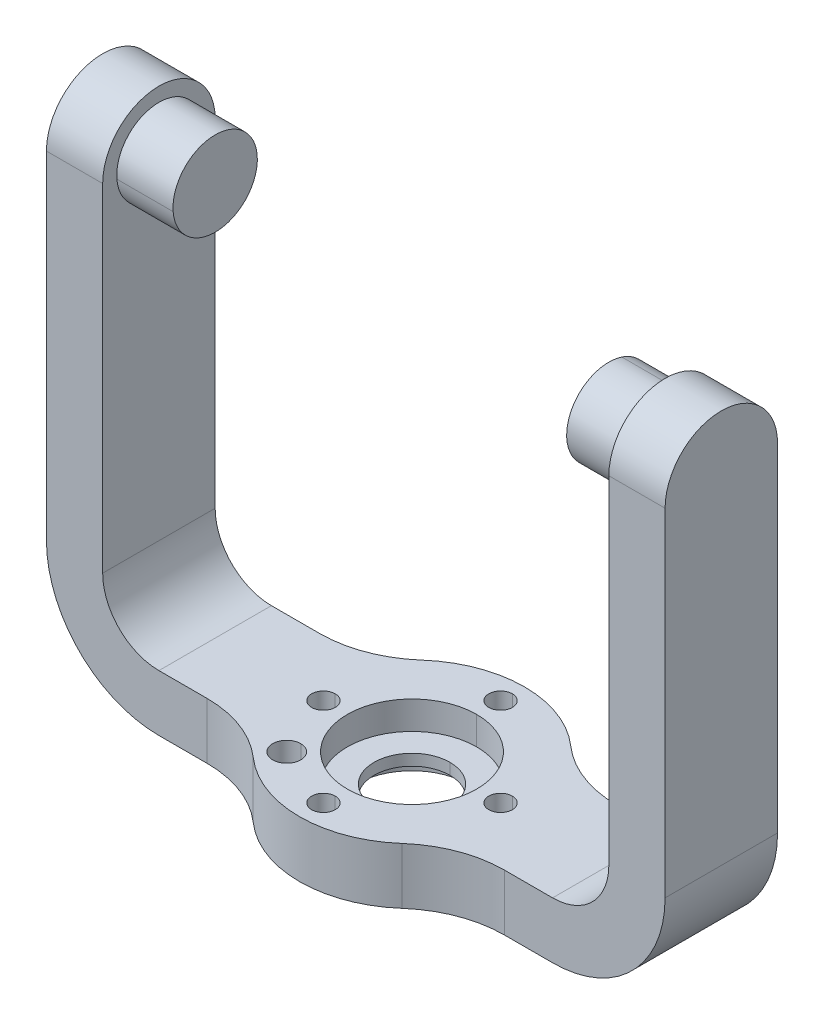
ISO-10303-21;
HEADER;
FILE_DESCRIPTION(('STEP AP214'),'2;1');
FILE_NAME('part.step','',(''),(''),'','','');
FILE_SCHEMA(('AUTOMOTIVE_DESIGN { 1 0 10303 214 1 1 1 1 }'));
ENDSEC;
DATA;
#1=APPLICATION_CONTEXT('core data for automotive mechanical design processes');
#2=APPLICATION_PROTOCOL_DEFINITION('international standard','automotive_design',2000,#1);
#3=PRODUCT_CONTEXT('',#1,'mechanical');
#4=PRODUCT('Part','Part','',(#3));
#5=PRODUCT_RELATED_PRODUCT_CATEGORY('part','',(#4));
#6=PRODUCT_DEFINITION_FORMATION('','',#4);
#7=PRODUCT_DEFINITION_CONTEXT('part definition',#1,'design');
#8=PRODUCT_DEFINITION('design','',#6,#7);
#9=PRODUCT_DEFINITION_SHAPE('','',#8);
#10=(LENGTH_UNIT() NAMED_UNIT(*) SI_UNIT(.MILLI.,.METRE.));
#11=(NAMED_UNIT(*) PLANE_ANGLE_UNIT() SI_UNIT($,.RADIAN.));
#12=(NAMED_UNIT(*) SI_UNIT($,.STERADIAN.) SOLID_ANGLE_UNIT());
#13=UNCERTAINTY_MEASURE_WITH_UNIT(LENGTH_MEASURE(1.E-05),#10,'distance_accuracy_value','');
#14=(GEOMETRIC_REPRESENTATION_CONTEXT(3) GLOBAL_UNCERTAINTY_ASSIGNED_CONTEXT((#13)) GLOBAL_UNIT_ASSIGNED_CONTEXT((#10,
#11,#12)) REPRESENTATION_CONTEXT('',''));
#15=CARTESIAN_POINT('',(0.,0.,0.));
#16=DIRECTION('',(0.,0.,1.));
#17=DIRECTION('',(1.,0.,0.));
#18=AXIS2_PLACEMENT_3D('',#15,#16,#17);
#19=CARTESIAN_POINT('',(-34.4979051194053,-883.502837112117,-27.4998739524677));
#20=DIRECTION('',(-0.999999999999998,0.,-7.07976703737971E-08));
#21=DIRECTION('',(7.05789379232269E-08,0.0785464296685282,-0.996910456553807));
#22=AXIS2_PLACEMENT_3D('',#19,#20,#21);
#23=CYLINDRICAL_SURFACE('',#22,7.5);
#24=CARTESIAN_POINT('',(35.0020948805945,-883.502837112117,-27.4998690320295));
#25=DIRECTION('',(0.999999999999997,0.,7.07976702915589E-08));
#26=DIRECTION('',(0.,0.999999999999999,0.));
#27=AXIS2_PLACEMENT_3D('',#24,#25,#26);
#28=CIRCLE('',#27,7.5);
#29=CARTESIAN_POINT('',(35.002095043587,-876.364928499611,-29.8020985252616));
#30=VERTEX_POINT('',#29);
#31=CARTESIAN_POINT('',(35.002094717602,-890.640745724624,-25.1976395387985));
#32=VERTEX_POINT('',#31);
#33=EDGE_CURVE('E9',#30,#32,#28,.F.);
#34=ORIENTED_EDGE('',*,*,#33,.F.);
#35=DIRECTION('',(-0.999999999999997,0.,-7.07976694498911E-08));
#36=VECTOR('',#35,1.);
#37=CARTESIAN_POINT('',(45.002095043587,-876.364928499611,-29.8020978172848));
#38=LINE('',#37,#36);
#39=CARTESIAN_POINT('',(45.002095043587,-876.364928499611,-29.8020978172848));
#40=VERTEX_POINT('',#39);
#41=EDGE_CURVE('E380',#40,#30,#38,.T.);
#42=ORIENTED_EDGE('',*,*,#41,.F.);
#43=CARTESIAN_POINT('',(45.0020948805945,-883.502837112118,-27.4998683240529));
#44=DIRECTION('',(0.999999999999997,0.,7.07976695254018E-08));
#45=DIRECTION('',(2.17323323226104E-08,0.951721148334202,-0.306963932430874));
#46=AXIS2_PLACEMENT_3D('',#43,#44,#45);
#47=CIRCLE('',#46,7.5);
#48=CARTESIAN_POINT('',(45.0020947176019,-890.640745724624,-25.1976388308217));
#49=VERTEX_POINT('',#48);
#50=EDGE_CURVE('E383',#49,#40,#47,.T.);
#51=ORIENTED_EDGE('',*,*,#50,.F.);
#52=DIRECTION('',(-0.999999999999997,0.,-7.07976694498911E-08));
#53=VECTOR('',#52,1.);
#54=CARTESIAN_POINT('',(45.002094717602,-890.640745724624,-25.1976388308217));
#55=LINE('',#54,#53);
#56=EDGE_CURVE('E1750',#49,#32,#55,.T.);
#57=ORIENTED_EDGE('',*,*,#56,.T.);
#58=EDGE_LOOP('',(#34,#42,#51,#57));
#59=FACE_BOUND('',#58,.T.);
#60=ADVANCED_FACE('F14',(#59),#23,.T.);
#61=EDGE_CURVE('E18',#32,#30,#28,.F.);
#62=ORIENTED_EDGE('',*,*,#61,.F.);
#63=ORIENTED_EDGE('',*,*,#56,.F.);
#64=CARTESIAN_POINT('',(45.0020948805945,-883.502837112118,-27.4998683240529));
#65=DIRECTION('',(0.999999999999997,0.,7.07976695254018E-08));
#66=DIRECTION('',(2.17323323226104E-08,0.951721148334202,-0.306963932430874));
#67=AXIS2_PLACEMENT_3D('',#64,#65,#66);
#68=CIRCLE('',#67,7.5);
#69=EDGE_CURVE('E1752',#40,#49,#68,.T.);
#70=ORIENTED_EDGE('',*,*,#69,.F.);
#71=ORIENTED_EDGE('',*,*,#41,.T.);
#72=EDGE_LOOP('',(#62,#63,#70,#71));
#73=FACE_BOUND('',#72,.T.);
#74=ADVANCED_FACE('F889',(#73),#23,.T.);
#75=CARTESIAN_POINT('',(-34.9979051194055,-883.502837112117,-27.4998739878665));
#76=DIRECTION('',(-0.999999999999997,0.,-7.07976702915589E-08));
#77=DIRECTION('',(0.,-1.,0.));
#78=AXIS2_PLACEMENT_3D('',#75,#76,#77);
#79=CIRCLE('',#78,7.5);
#80=CARTESIAN_POINT('',(-34.9979045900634,-882.913738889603,-34.9767024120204));
#81=VERTEX_POINT('',#80);
#82=CARTESIAN_POINT('',(-34.9979056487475,-884.091935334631,-20.0230455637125));
#83=VERTEX_POINT('',#82);
#84=EDGE_CURVE('E34',#81,#83,#79,.F.);
#85=ORIENTED_EDGE('',*,*,#84,.F.);
#86=DIRECTION('',(-0.999999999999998,0.,-7.07976699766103E-08));
#87=VECTOR('',#86,1.);
#88=CARTESIAN_POINT('',(-34.4979045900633,-882.913738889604,-34.9767023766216));
#89=LINE('',#88,#87);
#90=CARTESIAN_POINT('',(-44.9979045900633,-882.913738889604,-34.9767031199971));
#91=VERTEX_POINT('',#90);
#92=EDGE_CURVE('E359',#81,#91,#89,.T.);
#93=ORIENTED_EDGE('',*,*,#92,.T.);
#94=CARTESIAN_POINT('',(-44.9979051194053,-883.502837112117,-27.4998746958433));
#95=DIRECTION('',(0.999999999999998,0.,7.07976703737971E-08));
#96=DIRECTION('',(-7.05789379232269E-08,-0.0785464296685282,0.996910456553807));
#97=AXIS2_PLACEMENT_3D('',#94,#95,#96);
#98=CIRCLE('',#97,7.5);
#99=CARTESIAN_POINT('',(-44.9979056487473,-884.091935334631,-20.0230462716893));
#100=VERTEX_POINT('',#99);
#101=EDGE_CURVE('E368',#91,#100,#98,.T.);
#102=ORIENTED_EDGE('',*,*,#101,.T.);
#103=DIRECTION('',(-0.999999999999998,0.,-7.07976699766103E-08));
#104=VECTOR('',#103,1.);
#105=CARTESIAN_POINT('',(-34.4979056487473,-884.091935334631,-20.0230455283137));
#106=LINE('',#105,#104);
#107=EDGE_CURVE('E361',#83,#100,#106,.T.);
#108=ORIENTED_EDGE('',*,*,#107,.F.);
#109=EDGE_LOOP('',(#85,#93,#102,#108));
#110=FACE_BOUND('',#109,.T.);
#111=ADVANCED_FACE('F357',(#110),#23,.T.);
#112=CARTESIAN_POINT('',(0.00209488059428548,-993.029749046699,-27.4998715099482));
#113=DIRECTION('',(0.,0.999999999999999,0.));
#114=DIRECTION('',(-7.07976702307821E-08,0.,0.999999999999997));
#115=AXIS2_PLACEMENT_3D('',#112,#113,#114);
#116=CYLINDRICAL_SURFACE('',#115,11.5);
#117=DIRECTION('',(0.,0.999999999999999,0.));
#118=VECTOR('',#117,1.);
#119=CARTESIAN_POINT('',(0.0020956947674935,-993.029749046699,-38.9998715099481));
#120=LINE('',#119,#118);
#121=CARTESIAN_POINT('',(0.00209569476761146,-958.502837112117,-38.999871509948));
#122=VERTEX_POINT('',#121);
#123=CARTESIAN_POINT('',(0.00209569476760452,-953.502837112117,-38.999871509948));
#124=VERTEX_POINT('',#123);
#125=EDGE_CURVE('E664',#122,#124,#120,.T.);
#126=ORIENTED_EDGE('',*,*,#125,.F.);
#127=CARTESIAN_POINT('',(0.00209488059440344,-958.502837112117,-27.499871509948));
#128=DIRECTION('',(0.,0.999999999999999,0.));
#129=DIRECTION('',(7.07976702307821E-08,0.,-0.999999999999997));
#130=AXIS2_PLACEMENT_3D('',#127,#128,#129);
#131=CIRCLE('',#130,11.5);
#132=CARTESIAN_POINT('',(0.00209406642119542,-958.502837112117,-15.999871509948));
#133=VERTEX_POINT('',#132);
#134=EDGE_CURVE('E355',#133,#122,#131,.T.);
#135=ORIENTED_EDGE('',*,*,#134,.F.);
#136=DIRECTION('',(0.,0.999999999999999,0.));
#137=VECTOR('',#136,1.);
#138=CARTESIAN_POINT('',(0.00209406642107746,-993.029749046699,-15.9998715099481));
#139=LINE('',#138,#137);
#140=CARTESIAN_POINT('',(0.00209406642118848,-953.502837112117,-15.999871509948));
#141=VERTEX_POINT('',#140);
#142=EDGE_CURVE('E637',#133,#141,#139,.T.);
#143=ORIENTED_EDGE('',*,*,#142,.T.);
#144=CARTESIAN_POINT('',(0.0020948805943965,-953.502837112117,-27.499871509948));
#145=DIRECTION('',(0.,0.999999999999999,0.));
#146=DIRECTION('',(-7.07976702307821E-08,0.,0.999999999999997));
#147=AXIS2_PLACEMENT_3D('',#144,#145,#146);
#148=CIRCLE('',#147,11.5);
#149=EDGE_CURVE('E523',#141,#124,#148,.T.);
#150=ORIENTED_EDGE('',*,*,#149,.T.);
#151=EDGE_LOOP('',(#126,#135,#143,#150));
#152=FACE_BOUND('',#151,.T.);
#153=ADVANCED_FACE('F905',(#152),#116,.F.);
#154=CARTESIAN_POINT('',(0.00209488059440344,-958.502837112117,-27.499871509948));
#155=DIRECTION('',(0.,-0.999999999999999,0.));
#156=DIRECTION('',(0.999999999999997,0.,7.0797670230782E-08));
#157=AXIS2_PLACEMENT_3D('',#154,#155,#156);
#158=PLANE('',#157);
#159=CARTESIAN_POINT('',(0.00209488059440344,-958.502837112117,-27.499871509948));
#160=DIRECTION('',(0.,0.999999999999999,0.));
#161=DIRECTION('',(7.07976702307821E-08,0.,-0.999999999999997));
#162=AXIS2_PLACEMENT_3D('',#159,#160,#161);
#163=CIRCLE('',#162,6.75);
#164=CARTESIAN_POINT('',(0.00209440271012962,-958.502837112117,-20.749871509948));
#165=VERTEX_POINT('',#164);
#166=CARTESIAN_POINT('',(0.00209535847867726,-958.502837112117,-34.249871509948));
#167=VERTEX_POINT('',#166);
#168=EDGE_CURVE('E704',#165,#167,#163,.T.);
#169=ORIENTED_EDGE('',*,*,#168,.F.);
#170=CARTESIAN_POINT('',(0.00209488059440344,-958.502837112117,-27.499871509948));
#171=DIRECTION('',(0.,0.999999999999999,0.));
#172=DIRECTION('',(7.07976702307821E-08,0.,-0.999999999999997));
#173=AXIS2_PLACEMENT_3D('',#170,#171,#172);
#174=CIRCLE('',#173,6.75);
#175=EDGE_CURVE('E443',#167,#165,#174,.T.);
#176=ORIENTED_EDGE('',*,*,#175,.F.);
#177=EDGE_LOOP('',(#169,#176));
#178=FACE_BOUND('',#177,.T.);
#179=ORIENTED_EDGE('',*,*,#134,.T.);
#180=CARTESIAN_POINT('',(0.00209488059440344,-958.502837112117,-27.499871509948));
#181=DIRECTION('',(0.,0.999999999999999,0.));
#182=DIRECTION('',(7.07976702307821E-08,0.,-0.999999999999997));
#183=AXIS2_PLACEMENT_3D('',#180,#181,#182);
#184=CIRCLE('',#183,11.5);
#185=EDGE_CURVE('E416',#122,#133,#184,.T.);
#186=ORIENTED_EDGE('',*,*,#185,.T.);
#187=EDGE_LOOP('',(#179,#186));
#188=FACE_BOUND('',#187,.T.);
#189=ADVANCED_FACE('F909',(#178,#188),#158,.F.);
#190=CARTESIAN_POINT('',(0.00209488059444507,-938.502837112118,-27.499871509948));
#191=DIRECTION('',(0.,-0.999999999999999,0.));
#192=DIRECTION('',(7.07976702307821E-08,0.,-0.999999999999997));
#193=AXIS2_PLACEMENT_3D('',#190,#191,#192);
#194=CYLINDRICAL_SURFACE('',#193,20.);
#195=DIRECTION('',(0.,-0.999999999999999,0.));
#196=VECTOR('',#195,1.);
#197=CARTESIAN_POINT('',(-13.2266627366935,-938.502837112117,-12.4998724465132));
#198=LINE('',#197,#196);
#199=CARTESIAN_POINT('',(-13.2266627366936,-953.502837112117,-12.4998724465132));
#200=VERTEX_POINT('',#199);
#201=CARTESIAN_POINT('',(-13.2266627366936,-963.502837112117,-12.4998724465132));
#202=VERTEX_POINT('',#201);
#203=EDGE_CURVE('E438',#200,#202,#198,.T.);
#204=ORIENTED_EDGE('',*,*,#203,.T.);
#205=CARTESIAN_POINT('',(0.00209488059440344,-963.502837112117,-27.499871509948));
#206=DIRECTION('',(0.,0.999999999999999,0.));
#207=DIRECTION('',(-7.07976702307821E-08,0.,0.999999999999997));
#208=AXIS2_PLACEMENT_3D('',#205,#206,#207);
#209=CIRCLE('',#208,20.);
#210=CARTESIAN_POINT('',(13.2308503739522,-963.502837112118,-12.4998705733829));
#211=VERTEX_POINT('',#210);
#212=EDGE_CURVE('E493',#202,#211,#209,.T.);
#213=ORIENTED_EDGE('',*,*,#212,.T.);
#214=DIRECTION('',(0.,-0.999999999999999,0.));
#215=VECTOR('',#214,1.);
#216=CARTESIAN_POINT('',(13.2308503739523,-938.502837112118,-12.4998705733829));
#217=LINE('',#216,#215);
#218=CARTESIAN_POINT('',(13.2308503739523,-953.502837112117,-12.4998705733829));
#219=VERTEX_POINT('',#218);
#220=EDGE_CURVE('E434',#219,#211,#217,.T.);
#221=ORIENTED_EDGE('',*,*,#220,.F.);
#222=CARTESIAN_POINT('',(0.0020948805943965,-953.502837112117,-27.499871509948));
#223=DIRECTION('',(0.,0.999999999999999,0.));
#224=DIRECTION('',(7.0797672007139E-08,0.,-0.999999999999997));
#225=AXIS2_PLACEMENT_3D('',#222,#223,#224);
#226=CIRCLE('',#225,20.);
#227=EDGE_CURVE('E603',#200,#219,#226,.T.);
#228=ORIENTED_EDGE('',*,*,#227,.F.);
#229=EDGE_LOOP('',(#204,#213,#221,#228));
#230=FACE_BOUND('',#229,.T.);
#231=ADVANCED_FACE('F860',(#230),#194,.T.);
#232=CARTESIAN_POINT('',(26.4596072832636,-938.502837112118,-17.4998696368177));
#233=DIRECTION('',(7.07976701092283E-08,0.,-0.999999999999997));
#234=DIRECTION('',(0.999999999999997,0.,7.07976701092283E-08));
#235=AXIS2_PLACEMENT_3D('',#232,#233,#234);
#236=PLANE('',#235);
#237=DIRECTION('',(0.,-0.999999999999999,0.));
#238=VECTOR('',#237,1.);
#239=CARTESIAN_POINT('',(55.0020941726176,-938.502837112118,-17.4998676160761));
#240=LINE('',#239,#238);
#241=CARTESIAN_POINT('',(55.0020941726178,-883.502837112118,-17.4998676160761));
#242=VERTEX_POINT('',#241);
#243=CARTESIAN_POINT('',(55.0020941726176,-943.502837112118,-17.4998676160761));
#244=VERTEX_POINT('',#243);
#245=EDGE_CURVE('E479',#242,#244,#240,.T.);
#246=ORIENTED_EDGE('',*,*,#245,.F.);
#247=DIRECTION('',(-0.999999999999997,0.,-7.07976696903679E-08));
#248=VECTOR('',#247,1.);
#249=CARTESIAN_POINT('',(55.0020941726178,-883.502837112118,-17.4998676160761));
#250=LINE('',#249,#248);
#251=CARTESIAN_POINT('',(45.0020941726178,-883.502837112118,-17.4998683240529));
#252=VERTEX_POINT('',#251);
#253=EDGE_CURVE('E408',#242,#252,#250,.T.);
#254=ORIENTED_EDGE('',*,*,#253,.T.);
#255=DIRECTION('',(0.,0.999999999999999,0.));
#256=VECTOR('',#255,1.);
#257=CARTESIAN_POINT('',(45.0020941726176,-938.502837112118,-17.4998683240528));
#258=LINE('',#257,#256);
#259=CARTESIAN_POINT('',(45.0020941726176,-943.502837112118,-17.4998683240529));
#260=VERTEX_POINT('',#259);
#261=EDGE_CURVE('E478',#260,#252,#258,.T.);
#262=ORIENTED_EDGE('',*,*,#261,.F.);
#263=CARTESIAN_POINT('',(35.0020941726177,-943.502837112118,-17.4998690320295));
#264=DIRECTION('',(-7.07976700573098E-08,0.,0.999999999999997));
#265=DIRECTION('',(-0.999999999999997,0.,-7.07976700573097E-08));
#266=AXIS2_PLACEMENT_3D('',#263,#264,#265);
#267=CIRCLE('',#266,10.);
#268=CARTESIAN_POINT('',(35.0020941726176,-953.502837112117,-17.4998690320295));
#269=VERTEX_POINT('',#268);
#270=EDGE_CURVE('E488',#269,#260,#267,.T.);
#271=ORIENTED_EDGE('',*,*,#270,.F.);
#272=DIRECTION('',(0.999999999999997,0.,7.07976701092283E-08));
#273=VECTOR('',#272,1.);
#274=CARTESIAN_POINT('',(35.0020941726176,-953.502837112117,-17.4998690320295));
#275=LINE('',#274,#273);
#276=CARTESIAN_POINT('',(26.4596072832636,-953.502837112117,-17.4998696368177));
#277=VERTEX_POINT('',#276);
#278=EDGE_CURVE('E570',#277,#269,#275,.T.);
#279=ORIENTED_EDGE('',*,*,#278,.F.);
#280=DIRECTION('',(0.,-0.999999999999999,0.));
#281=VECTOR('',#280,1.);
#282=CARTESIAN_POINT('',(26.4596072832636,-938.502837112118,-17.4998696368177));
#283=LINE('',#282,#281);
#284=CARTESIAN_POINT('',(26.4596072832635,-963.502837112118,-17.4998696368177));
#285=VERTEX_POINT('',#284);
#286=EDGE_CURVE('E437',#277,#285,#283,.T.);
#287=ORIENTED_EDGE('',*,*,#286,.T.);
#288=DIRECTION('',(0.999999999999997,0.,7.07976701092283E-08));
#289=VECTOR('',#288,1.);
#290=CARTESIAN_POINT('',(26.4596072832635,-963.502837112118,-17.4998696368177));
#291=LINE('',#290,#289);
#292=CARTESIAN_POINT('',(35.0020941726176,-963.502837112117,-17.4998690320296));
#293=VERTEX_POINT('',#292);
#294=EDGE_CURVE('E473',#285,#293,#291,.T.);
#295=ORIENTED_EDGE('',*,*,#294,.T.);
#296=CARTESIAN_POINT('',(35.0020941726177,-943.502837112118,-17.4998690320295));
#297=DIRECTION('',(7.07976701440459E-08,0.,-0.999999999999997));
#298=DIRECTION('',(-0.999999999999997,0.,-7.07976701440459E-08));
#299=AXIS2_PLACEMENT_3D('',#296,#297,#298);
#300=CIRCLE('',#299,20.);
#301=EDGE_CURVE('E579',#244,#293,#300,.T.);
#302=ORIENTED_EDGE('',*,*,#301,.F.);
#303=EDGE_LOOP('',(#246,#254,#262,#271,#279,#287,#295,#302));
#304=FACE_BOUND('',#303,.T.);
#305=ADVANCED_FACE('F853',(#304),#236,.F.);
#306=CARTESIAN_POINT('',(26.4596058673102,-938.502837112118,2.5001303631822));
#307=DIRECTION('',(0.,-0.999999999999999,0.));
#308=DIRECTION('',(7.07976702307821E-08,0.,-0.999999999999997));
#309=AXIS2_PLACEMENT_3D('',#306,#307,#308);
#310=CYLINDRICAL_SURFACE('',#309,20.);
#311=ORIENTED_EDGE('',*,*,#220,.T.);
#312=CARTESIAN_POINT('',(26.4596058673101,-963.502837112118,2.5001303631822));
#313=DIRECTION('',(0.,-0.999999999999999,0.));
#314=DIRECTION('',(-7.07976702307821E-08,0.,0.999999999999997));
#315=AXIS2_PLACEMENT_3D('',#312,#313,#314);
#316=CIRCLE('',#315,20.);
#317=EDGE_CURVE('E489',#211,#285,#316,.T.);
#318=ORIENTED_EDGE('',*,*,#317,.T.);
#319=ORIENTED_EDGE('',*,*,#286,.F.);
#320=CARTESIAN_POINT('',(26.4596058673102,-953.502837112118,2.5001303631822));
#321=DIRECTION('',(0.,-0.999999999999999,0.));
#322=DIRECTION('',(7.07976702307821E-08,0.,-0.999999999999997));
#323=AXIS2_PLACEMENT_3D('',#320,#321,#322);
#324=CIRCLE('',#323,20.);
#325=EDGE_CURVE('E607',#219,#277,#324,.T.);
#326=ORIENTED_EDGE('',*,*,#325,.F.);
#327=EDGE_LOOP('',(#311,#318,#319,#326));
#328=FACE_BOUND('',#327,.T.);
#329=ADVANCED_FACE('F857',(#328),#310,.F.);
#330=CARTESIAN_POINT('',(-26.4554203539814,-938.502837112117,2.50012661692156));
#331=DIRECTION('',(0.,-0.999999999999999,0.));
#332=DIRECTION('',(7.07976702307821E-08,0.,-0.999999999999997));
#333=AXIS2_PLACEMENT_3D('',#330,#331,#332);
#334=CYLINDRICAL_SURFACE('',#333,20.);
#335=DIRECTION('',(0.,-0.999999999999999,0.));
#336=VECTOR('',#335,1.);
#337=CARTESIAN_POINT('',(-26.455418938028,-938.502837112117,-17.4998733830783));
#338=LINE('',#337,#336);
#339=CARTESIAN_POINT('',(-26.4554189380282,-953.502837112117,-17.4998733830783));
#340=VERTEX_POINT('',#339);
#341=CARTESIAN_POINT('',(-26.4554189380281,-963.502837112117,-17.4998733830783));
#342=VERTEX_POINT('',#341);
#343=EDGE_CURVE('E586',#340,#342,#338,.T.);
#344=ORIENTED_EDGE('',*,*,#343,.T.);
#345=CARTESIAN_POINT('',(-26.4554203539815,-963.502837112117,2.50012661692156));
#346=DIRECTION('',(0.,-0.999999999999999,0.));
#347=DIRECTION('',(-7.07976702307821E-08,0.,0.999999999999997));
#348=AXIS2_PLACEMENT_3D('',#345,#346,#347);
#349=CIRCLE('',#348,20.);
#350=EDGE_CURVE('E669',#342,#202,#349,.T.);
#351=ORIENTED_EDGE('',*,*,#350,.T.);
#352=ORIENTED_EDGE('',*,*,#203,.F.);
#353=CARTESIAN_POINT('',(-26.4554203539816,-953.502837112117,2.50012661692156));
#354=DIRECTION('',(0.,-0.999999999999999,0.));
#355=DIRECTION('',(7.07976702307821E-08,0.,-0.999999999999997));
#356=AXIS2_PLACEMENT_3D('',#353,#354,#355);
#357=CIRCLE('',#356,20.);
#358=EDGE_CURVE('E552',#340,#200,#357,.T.);
#359=ORIENTED_EDGE('',*,*,#358,.F.);
#360=EDGE_LOOP('',(#344,#351,#352,#359));
#361=FACE_BOUND('',#360,.T.);
#362=ADVANCED_FACE('F810',(#361),#334,.F.);
#363=CARTESIAN_POINT('',(-54.9979058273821,-938.502837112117,-17.4998754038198));
#364=DIRECTION('',(7.07976701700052E-08,0.,-0.999999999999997));
#365=DIRECTION('',(0.999999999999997,0.,7.07976701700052E-08));
#366=AXIS2_PLACEMENT_3D('',#363,#364,#365);
#367=PLANE('',#366);
#368=CARTESIAN_POINT('',(-34.9979058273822,-943.502837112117,-17.4998739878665));
#369=DIRECTION('',(-7.07976702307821E-08,0.,0.999999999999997));
#370=DIRECTION('',(-0.999999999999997,0.,-7.0797670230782E-08));
#371=AXIS2_PLACEMENT_3D('',#368,#369,#370);
#372=CIRCLE('',#371,10.);
#373=CARTESIAN_POINT('',(-44.9979058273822,-943.502837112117,-17.4998746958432));
#374=VERTEX_POINT('',#373);
#375=CARTESIAN_POINT('',(-34.9979058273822,-953.502837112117,-17.4998739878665));
#376=VERTEX_POINT('',#375);
#377=EDGE_CURVE('E462',#374,#376,#372,.T.);
#378=ORIENTED_EDGE('',*,*,#377,.F.);
#379=DIRECTION('',(0.,-0.999999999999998,0.));
#380=VECTOR('',#379,1.);
#381=CARTESIAN_POINT('',(-44.9979058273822,-943.502837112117,-17.4998746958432));
#382=LINE('',#381,#380);
#383=CARTESIAN_POINT('',(-44.997905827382,-883.502837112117,-17.4998746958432));
#384=VERTEX_POINT('',#383);
#385=EDGE_CURVE('E461',#384,#374,#382,.T.);
#386=ORIENTED_EDGE('',*,*,#385,.F.);
#387=DIRECTION('',(-0.999999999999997,0.,-7.07976697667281E-08));
#388=VECTOR('',#387,1.);
#389=CARTESIAN_POINT('',(-44.997905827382,-883.502837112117,-17.4998746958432));
#390=LINE('',#389,#388);
#391=CARTESIAN_POINT('',(-54.9979058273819,-883.502837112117,-17.4998754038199));
#392=VERTEX_POINT('',#391);
#393=EDGE_CURVE('E390',#384,#392,#390,.T.);
#394=ORIENTED_EDGE('',*,*,#393,.T.);
#395=DIRECTION('',(0.,-0.999999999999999,0.));
#396=VECTOR('',#395,1.);
#397=CARTESIAN_POINT('',(-54.9979058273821,-938.502837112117,-17.4998754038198));
#398=LINE('',#397,#396);
#399=CARTESIAN_POINT('',(-54.997905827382,-943.502837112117,-17.4998754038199));
#400=VERTEX_POINT('',#399);
#401=EDGE_CURVE('E467',#392,#400,#398,.T.);
#402=ORIENTED_EDGE('',*,*,#401,.T.);
#403=CARTESIAN_POINT('',(-34.9979058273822,-943.502837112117,-17.4998739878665));
#404=DIRECTION('',(7.07976701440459E-08,0.,-0.999999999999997));
#405=DIRECTION('',(-0.999999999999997,0.,-7.07976701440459E-08));
#406=AXIS2_PLACEMENT_3D('',#403,#404,#405);
#407=CIRCLE('',#406,20.);
#408=CARTESIAN_POINT('',(-34.9979058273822,-963.502837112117,-17.4998739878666));
#409=VERTEX_POINT('',#408);
#410=EDGE_CURVE('E670',#409,#400,#407,.T.);
#411=ORIENTED_EDGE('',*,*,#410,.F.);
#412=DIRECTION('',(0.999999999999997,0.,7.07976701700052E-08));
#413=VECTOR('',#412,1.);
#414=CARTESIAN_POINT('',(-54.9979058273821,-963.502837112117,-17.4998754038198));
#415=LINE('',#414,#413);
#416=EDGE_CURVE('E652',#409,#342,#415,.T.);
#417=ORIENTED_EDGE('',*,*,#416,.T.);
#418=ORIENTED_EDGE('',*,*,#343,.F.);
#419=DIRECTION('',(0.999999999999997,0.,7.07976701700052E-08));
#420=VECTOR('',#419,1.);
#421=CARTESIAN_POINT('',(35.0020941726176,-953.502837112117,-17.4998690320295));
#422=LINE('',#421,#420);
#423=EDGE_CURVE('E527',#376,#340,#422,.T.);
#424=ORIENTED_EDGE('',*,*,#423,.F.);
#425=EDGE_LOOP('',(#378,#386,#394,#402,#411,#417,#418,#424));
#426=FACE_BOUND('',#425,.T.);
#427=ADVANCED_FACE('F793',(#426),#367,.F.);
#428=CARTESIAN_POINT('',(26.4596101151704,-938.502837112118,-57.4998696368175));
#429=DIRECTION('',(0.,-0.999999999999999,0.));
#430=DIRECTION('',(7.07976702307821E-08,0.,-0.999999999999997));
#431=AXIS2_PLACEMENT_3D('',#428,#429,#430);
#432=CYLINDRICAL_SURFACE('',#431,20.);
#433=DIRECTION('',(0.,-0.999999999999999,0.));
#434=VECTOR('',#433,1.);
#435=CARTESIAN_POINT('',(26.459608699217,-938.502837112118,-37.4998696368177));
#436=LINE('',#435,#434);
#437=CARTESIAN_POINT('',(26.459608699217,-953.502837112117,-37.4998696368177));
#438=VERTEX_POINT('',#437);
#439=CARTESIAN_POINT('',(26.4596086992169,-963.502837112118,-37.4998696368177));
#440=VERTEX_POINT('',#439);
#441=EDGE_CURVE('E535',#438,#440,#436,.T.);
#442=ORIENTED_EDGE('',*,*,#441,.T.);
#443=CARTESIAN_POINT('',(26.4596101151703,-963.502837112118,-57.4998696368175));
#444=DIRECTION('',(0.,-0.999999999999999,0.));
#445=DIRECTION('',(-7.07976702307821E-08,0.,0.999999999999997));
#446=AXIS2_PLACEMENT_3D('',#443,#444,#445);
#447=CIRCLE('',#446,20.);
#448=CARTESIAN_POINT('',(13.2308524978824,-963.502837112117,-42.4998705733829));
#449=VERTEX_POINT('',#448);
#450=EDGE_CURVE('E426',#440,#449,#447,.T.);
#451=ORIENTED_EDGE('',*,*,#450,.T.);
#452=DIRECTION('',(0.,-0.999999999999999,0.));
#453=VECTOR('',#452,1.);
#454=CARTESIAN_POINT('',(13.2308524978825,-938.502837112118,-42.4998705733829));
#455=LINE('',#454,#453);
#456=CARTESIAN_POINT('',(13.2308524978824,-953.502837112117,-42.4998705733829));
#457=VERTEX_POINT('',#456);
#458=EDGE_CURVE('E532',#457,#449,#455,.T.);
#459=ORIENTED_EDGE('',*,*,#458,.F.);
#460=CARTESIAN_POINT('',(26.4596101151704,-953.502837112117,-57.4998696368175));
#461=DIRECTION('',(0.,-0.999999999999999,0.));
#462=DIRECTION('',(7.07976702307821E-08,0.,-0.999999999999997));
#463=AXIS2_PLACEMENT_3D('',#460,#461,#462);
#464=CIRCLE('',#463,20.);
#465=EDGE_CURVE('E484',#438,#457,#464,.T.);
#466=ORIENTED_EDGE('',*,*,#465,.F.);
#467=EDGE_LOOP('',(#442,#451,#459,#466));
#468=FACE_BOUND('',#467,.T.);
#469=ADVANCED_FACE('F841',(#468),#432,.F.);
#470=CARTESIAN_POINT('',(26.459608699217,-938.502837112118,-37.4998696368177));
#471=DIRECTION('',(-7.07976703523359E-08,0.,0.999999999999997));
#472=DIRECTION('',(-0.999999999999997,0.,-7.07976703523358E-08));
#473=AXIS2_PLACEMENT_3D('',#470,#471,#472);
#474=PLANE('',#473);
#475=DIRECTION('',(-0.999999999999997,0.,-7.07976703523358E-08));
#476=VECTOR('',#475,1.);
#477=CARTESIAN_POINT('',(26.4596086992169,-963.502837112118,-37.4998696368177));
#478=LINE('',#477,#476);
#479=CARTESIAN_POINT('',(35.002095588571,-963.502837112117,-37.4998690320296));
#480=VERTEX_POINT('',#479);
#481=EDGE_CURVE('E474',#480,#440,#478,.T.);
#482=ORIENTED_EDGE('',*,*,#481,.T.);
#483=ORIENTED_EDGE('',*,*,#441,.F.);
#484=DIRECTION('',(-0.999999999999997,0.,-7.07976703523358E-08));
#485=VECTOR('',#484,1.);
#486=CARTESIAN_POINT('',(35.002095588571,-953.502837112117,-37.4998690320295));
#487=LINE('',#486,#485);
#488=CARTESIAN_POINT('',(35.002095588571,-953.502837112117,-37.4998690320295));
#489=VERTEX_POINT('',#488);
#490=EDGE_CURVE('E566',#489,#438,#487,.T.);
#491=ORIENTED_EDGE('',*,*,#490,.F.);
#492=CARTESIAN_POINT('',(35.0020955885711,-943.502837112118,-37.4998690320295));
#493=DIRECTION('',(7.07976704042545E-08,0.,-0.999999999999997));
#494=DIRECTION('',(0.999999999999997,0.,7.07976704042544E-08));
#495=AXIS2_PLACEMENT_3D('',#492,#493,#494);
#496=CIRCLE('',#495,10.);
#497=CARTESIAN_POINT('',(45.002095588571,-943.502837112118,-37.4998683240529));
#498=VERTEX_POINT('',#497);
#499=EDGE_CURVE('E445',#498,#489,#496,.T.);
#500=ORIENTED_EDGE('',*,*,#499,.F.);
#501=DIRECTION('',(0.,-0.999999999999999,0.));
#502=VECTOR('',#501,1.);
#503=CARTESIAN_POINT('',(45.002095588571,-938.502837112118,-37.4998683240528));
#504=LINE('',#503,#502);
#505=CARTESIAN_POINT('',(45.0020955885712,-883.502837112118,-37.4998683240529));
#506=VERTEX_POINT('',#505);
#507=EDGE_CURVE('E648',#506,#498,#504,.T.);
#508=ORIENTED_EDGE('',*,*,#507,.F.);
#509=DIRECTION('',(-0.999999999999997,0.,-7.07976696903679E-08));
#510=VECTOR('',#509,1.);
#511=CARTESIAN_POINT('',(55.0020955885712,-883.502837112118,-37.4998676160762));
#512=LINE('',#511,#510);
#513=CARTESIAN_POINT('',(55.0020955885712,-883.502837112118,-37.4998676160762));
#514=VERTEX_POINT('',#513);
#515=EDGE_CURVE('E412',#514,#506,#512,.T.);
#516=ORIENTED_EDGE('',*,*,#515,.F.);
#517=DIRECTION('',(0.,-0.999999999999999,0.));
#518=VECTOR('',#517,1.);
#519=CARTESIAN_POINT('',(55.0020955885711,-938.502837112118,-37.4998676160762));
#520=LINE('',#519,#518);
#521=CARTESIAN_POINT('',(55.0020955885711,-943.502837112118,-37.4998676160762));
#522=VERTEX_POINT('',#521);
#523=EDGE_CURVE('E475',#514,#522,#520,.T.);
#524=ORIENTED_EDGE('',*,*,#523,.T.);
#525=CARTESIAN_POINT('',(35.0020955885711,-943.502837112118,-37.4998690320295));
#526=DIRECTION('',(-7.07976703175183E-08,0.,0.999999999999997));
#527=DIRECTION('',(0.999999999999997,0.,7.07976703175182E-08));
#528=AXIS2_PLACEMENT_3D('',#525,#526,#527);
#529=CIRCLE('',#528,20.);
#530=EDGE_CURVE('E582',#480,#522,#529,.T.);
#531=ORIENTED_EDGE('',*,*,#530,.F.);
#532=EDGE_LOOP('',(#482,#483,#491,#500,#508,#516,#524,#531));
#533=FACE_BOUND('',#532,.T.);
#534=ADVANCED_FACE('F846',(#533),#474,.F.);
#535=CARTESIAN_POINT('',(0.00209488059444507,-938.502837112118,-27.499871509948));
#536=DIRECTION('',(0.,-0.999999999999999,0.));
#537=DIRECTION('',(7.07976702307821E-08,0.,-0.999999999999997));
#538=AXIS2_PLACEMENT_3D('',#535,#536,#537);
#539=CYLINDRICAL_SURFACE('',#538,20.);
#540=DIRECTION('',(0.,-0.999999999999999,0.));
#541=VECTOR('',#540,1.);
#542=CARTESIAN_POINT('',(0.00209629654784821,-938.502837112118,-47.4998715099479));
#543=LINE('',#542,#541);
#544=CARTESIAN_POINT('',(0.00209629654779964,-953.502837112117,-47.4998715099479));
#545=VERTEX_POINT('',#544);
#546=CARTESIAN_POINT('',(0.00209629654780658,-963.502837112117,-47.4998715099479));
#547=VERTEX_POINT('',#546);
#548=EDGE_CURVE('E589',#545,#547,#543,.T.);
#549=ORIENTED_EDGE('',*,*,#548,.F.);
#550=CARTESIAN_POINT('',(0.0020948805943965,-953.502837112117,-27.499871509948));
#551=DIRECTION('',(0.,0.999999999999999,0.));
#552=DIRECTION('',(7.07976675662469E-08,0.,-0.999999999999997));
#553=AXIS2_PLACEMENT_3D('',#550,#551,#552);
#554=CIRCLE('',#553,20.);
#555=EDGE_CURVE('E480',#457,#545,#554,.T.);
#556=ORIENTED_EDGE('',*,*,#555,.F.);
#557=ORIENTED_EDGE('',*,*,#458,.T.);
#558=CARTESIAN_POINT('',(0.00209488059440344,-963.502837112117,-27.499871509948));
#559=DIRECTION('',(0.,0.999999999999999,0.));
#560=DIRECTION('',(-7.07976702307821E-08,0.,0.999999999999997));
#561=AXIS2_PLACEMENT_3D('',#558,#559,#560);
#562=CIRCLE('',#561,20.);
#563=EDGE_CURVE('E423',#449,#547,#562,.T.);
#564=ORIENTED_EDGE('',*,*,#563,.T.);
#565=EDGE_LOOP('',(#549,#556,#557,#564));
#566=FACE_BOUND('',#565,.T.);
#567=ADVANCED_FACE('F838',(#566),#539,.T.);
#568=CARTESIAN_POINT('',(-26.4554161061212,-938.502837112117,-57.4998733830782));
#569=DIRECTION('',(0.,-0.999999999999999,0.));
#570=DIRECTION('',(7.07976702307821E-08,0.,-0.999999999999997));
#571=AXIS2_PLACEMENT_3D('',#568,#569,#570);
#572=CYLINDRICAL_SURFACE('',#571,20.);
#573=DIRECTION('',(0.,-0.999999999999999,0.));
#574=VECTOR('',#573,1.);
#575=CARTESIAN_POINT('',(-13.2266606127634,-938.502837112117,-42.4998724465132));
#576=LINE('',#575,#574);
#577=CARTESIAN_POINT('',(-13.2266606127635,-953.502837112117,-42.4998724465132));
#578=VERTEX_POINT('',#577);
#579=CARTESIAN_POINT('',(-13.2266606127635,-963.502837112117,-42.4998724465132));
#580=VERTEX_POINT('',#579);
#581=EDGE_CURVE('E504',#578,#580,#576,.T.);
#582=ORIENTED_EDGE('',*,*,#581,.T.);
#583=CARTESIAN_POINT('',(-26.4554161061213,-963.502837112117,-57.4998733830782));
#584=DIRECTION('',(0.,-0.999999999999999,0.));
#585=DIRECTION('',(-7.07976702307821E-08,0.,0.999999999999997));
#586=AXIS2_PLACEMENT_3D('',#583,#584,#585);
#587=CIRCLE('',#586,20.);
#588=CARTESIAN_POINT('',(-26.4554175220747,-963.502837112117,-37.4998733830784));
#589=VERTEX_POINT('',#588);
#590=EDGE_CURVE('E427',#580,#589,#587,.T.);
#591=ORIENTED_EDGE('',*,*,#590,.T.);
#592=DIRECTION('',(0.,-0.999999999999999,0.));
#593=VECTOR('',#592,1.);
#594=CARTESIAN_POINT('',(-26.4554175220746,-938.502837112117,-37.4998733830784));
#595=LINE('',#594,#593);
#596=CARTESIAN_POINT('',(-26.4554175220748,-953.502837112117,-37.4998733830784));
#597=VERTEX_POINT('',#596);
#598=EDGE_CURVE('E536',#597,#589,#595,.T.);
#599=ORIENTED_EDGE('',*,*,#598,.F.);
#600=CARTESIAN_POINT('',(-26.4554161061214,-953.502837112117,-57.4998733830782));
#601=DIRECTION('',(0.,-0.999999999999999,0.));
#602=DIRECTION('',(7.07976702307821E-08,0.,-0.999999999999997));
#603=AXIS2_PLACEMENT_3D('',#600,#601,#602);
#604=CIRCLE('',#603,20.);
#605=EDGE_CURVE('E483',#578,#597,#604,.T.);
#606=ORIENTED_EDGE('',*,*,#605,.F.);
#607=EDGE_LOOP('',(#582,#591,#599,#606));
#608=FACE_BOUND('',#607,.T.);
#609=ADVANCED_FACE('F827',(#608),#572,.F.);
#610=CARTESIAN_POINT('',(-54.9979044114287,-938.502837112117,-37.4998754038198));
#611=DIRECTION('',(-7.0797670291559E-08,0.,0.999999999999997));
#612=DIRECTION('',(-0.999999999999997,0.,-7.07976702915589E-08));
#613=AXIS2_PLACEMENT_3D('',#610,#611,#612);
#614=PLANE('',#613);
#615=ORIENTED_EDGE('',*,*,#598,.T.);
#616=DIRECTION('',(-0.999999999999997,0.,-7.07976702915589E-08));
#617=VECTOR('',#616,1.);
#618=CARTESIAN_POINT('',(-54.9979044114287,-963.502837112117,-37.4998754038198));
#619=LINE('',#618,#617);
#620=CARTESIAN_POINT('',(-34.9979044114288,-963.502837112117,-37.4998739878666));
#621=VERTEX_POINT('',#620);
#622=EDGE_CURVE('E649',#589,#621,#619,.T.);
#623=ORIENTED_EDGE('',*,*,#622,.T.);
#624=CARTESIAN_POINT('',(-34.9979044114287,-943.502837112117,-37.4998739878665));
#625=DIRECTION('',(-7.07976703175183E-08,0.,0.999999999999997));
#626=DIRECTION('',(0.999999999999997,0.,7.07976703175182E-08));
#627=AXIS2_PLACEMENT_3D('',#624,#625,#626);
#628=CIRCLE('',#627,20.);
#629=CARTESIAN_POINT('',(-54.9979044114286,-943.502837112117,-37.4998754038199));
#630=VERTEX_POINT('',#629);
#631=EDGE_CURVE('E665',#630,#621,#628,.T.);
#632=ORIENTED_EDGE('',*,*,#631,.F.);
#633=DIRECTION('',(0.,-0.999999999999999,0.));
#634=VECTOR('',#633,1.);
#635=CARTESIAN_POINT('',(-54.9979044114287,-938.502837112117,-37.4998754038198));
#636=LINE('',#635,#634);
#637=CARTESIAN_POINT('',(-54.9979044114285,-883.502837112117,-37.4998754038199));
#638=VERTEX_POINT('',#637);
#639=EDGE_CURVE('E718',#638,#630,#636,.T.);
#640=ORIENTED_EDGE('',*,*,#639,.F.);
#641=DIRECTION('',(-0.999999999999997,0.,-7.07976697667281E-08));
#642=VECTOR('',#641,1.);
#643=CARTESIAN_POINT('',(-44.9979044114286,-883.502837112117,-37.4998746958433));
#644=LINE('',#643,#642);
#645=CARTESIAN_POINT('',(-44.9979044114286,-883.502837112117,-37.4998746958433));
#646=VERTEX_POINT('',#645);
#647=EDGE_CURVE('E385',#646,#638,#644,.T.);
#648=ORIENTED_EDGE('',*,*,#647,.F.);
#649=DIRECTION('',(0.,0.999999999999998,0.));
#650=VECTOR('',#649,1.);
#651=CARTESIAN_POINT('',(-44.9979044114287,-943.502837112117,-37.4998746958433));
#652=LINE('',#651,#650);
#653=CARTESIAN_POINT('',(-44.9979044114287,-943.502837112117,-37.4998746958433));
#654=VERTEX_POINT('',#653);
#655=EDGE_CURVE('E468',#654,#646,#652,.T.);
#656=ORIENTED_EDGE('',*,*,#655,.F.);
#657=CARTESIAN_POINT('',(-34.9979044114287,-943.502837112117,-37.4998739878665));
#658=DIRECTION('',(7.07976702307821E-08,0.,-0.999999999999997));
#659=DIRECTION('',(0.999999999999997,0.,7.0797670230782E-08));
#660=AXIS2_PLACEMENT_3D('',#657,#658,#659);
#661=CIRCLE('',#660,10.);
#662=CARTESIAN_POINT('',(-34.9979044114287,-953.502837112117,-37.4998739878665));
#663=VERTEX_POINT('',#662);
#664=EDGE_CURVE('E457',#663,#654,#661,.T.);
#665=ORIENTED_EDGE('',*,*,#664,.F.);
#666=DIRECTION('',(-0.999999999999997,0.,-7.07976702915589E-08));
#667=VECTOR('',#666,1.);
#668=CARTESIAN_POINT('',(35.002095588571,-953.502837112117,-37.4998690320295));
#669=LINE('',#668,#667);
#670=EDGE_CURVE('E602',#597,#663,#669,.T.);
#671=ORIENTED_EDGE('',*,*,#670,.F.);
#672=EDGE_LOOP('',(#615,#623,#632,#640,#648,#656,#665,#671));
#673=FACE_BOUND('',#672,.T.);
#674=ADVANCED_FACE('F825',(#673),#614,.F.);
#675=CARTESIAN_POINT('',(0.00209376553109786,-963.502837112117,-11.749871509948));
#676=DIRECTION('',(0.,-0.999999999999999,0.));
#677=DIRECTION('',(7.07976702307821E-08,0.,-0.999999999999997));
#678=AXIS2_PLACEMENT_3D('',#675,#676,#677);
#679=CYLINDRICAL_SURFACE('',#678,2.1);
#680=DIRECTION('',(0.,-0.999999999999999,0.));
#681=VECTOR('',#680,1.);
#682=CARTESIAN_POINT('',(0.00209361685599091,-963.502837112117,-9.649871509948));
#683=LINE('',#682,#681);
#684=CARTESIAN_POINT('',(0.00209361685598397,-953.502837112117,-9.649871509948));
#685=VERTEX_POINT('',#684);
#686=CARTESIAN_POINT('',(0.00209361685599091,-963.502837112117,-9.649871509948));
#687=VERTEX_POINT('',#686);
#688=EDGE_CURVE('E503',#685,#687,#683,.T.);
#689=ORIENTED_EDGE('',*,*,#688,.F.);
#690=CARTESIAN_POINT('',(0.00209376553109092,-953.502837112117,-11.749871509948));
#691=DIRECTION('',(0.,-0.999999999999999,0.));
#692=DIRECTION('',(7.07976702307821E-08,0.,-0.999999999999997));
#693=AXIS2_PLACEMENT_3D('',#690,#691,#692);
#694=CIRCLE('',#693,2.1);
#695=CARTESIAN_POINT('',(0.00209391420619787,-953.502837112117,-13.849871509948));
#696=VERTEX_POINT('',#695);
#697=EDGE_CURVE('E498',#696,#685,#694,.T.);
#698=ORIENTED_EDGE('',*,*,#697,.F.);
#699=DIRECTION('',(0.,-0.999999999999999,0.));
#700=VECTOR('',#699,1.);
#701=CARTESIAN_POINT('',(0.00209391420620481,-963.502837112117,-13.849871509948));
#702=LINE('',#701,#700);
#703=CARTESIAN_POINT('',(0.00209391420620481,-963.502837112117,-13.849871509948));
#704=VERTEX_POINT('',#703);
#705=EDGE_CURVE('E642',#696,#704,#702,.T.);
#706=ORIENTED_EDGE('',*,*,#705,.T.);
#707=CARTESIAN_POINT('',(0.00209376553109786,-963.502837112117,-11.749871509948));
#708=DIRECTION('',(0.,-0.999999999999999,0.));
#709=DIRECTION('',(7.07976702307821E-08,0.,-0.999999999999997));
#710=AXIS2_PLACEMENT_3D('',#707,#708,#709);
#711=CIRCLE('',#710,2.1);
#712=EDGE_CURVE('E585',#704,#687,#711,.T.);
#713=ORIENTED_EDGE('',*,*,#712,.T.);
#714=EDGE_LOOP('',(#689,#698,#706,#713));
#715=FACE_BOUND('',#714,.T.);
#716=ADVANCED_FACE('F983',(#715),#679,.F.);
#717=CARTESIAN_POINT('',(-15.7479051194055,-963.502837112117,-27.4998726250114));
#718=DIRECTION('',(0.,-0.999999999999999,0.));
#719=DIRECTION('',(7.07976702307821E-08,0.,-0.999999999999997));
#720=AXIS2_PLACEMENT_3D('',#717,#718,#719);
#721=CYLINDRICAL_SURFACE('',#720,2.1);
#722=DIRECTION('',(0.,-0.999999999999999,0.));
#723=VECTOR('',#722,1.);
#724=CARTESIAN_POINT('',(-15.7479052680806,-963.502837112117,-25.3998726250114));
#725=LINE('',#724,#723);
#726=CARTESIAN_POINT('',(-15.7479052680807,-953.502837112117,-25.3998726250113));
#727=VERTEX_POINT('',#726);
#728=CARTESIAN_POINT('',(-15.7479052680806,-963.502837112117,-25.3998726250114));
#729=VERTEX_POINT('',#728);
#730=EDGE_CURVE('E540',#727,#729,#725,.T.);
#731=ORIENTED_EDGE('',*,*,#730,.F.);
#732=CARTESIAN_POINT('',(-15.7479051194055,-953.502837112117,-27.4998726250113));
#733=DIRECTION('',(0.,-0.999999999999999,0.));
#734=DIRECTION('',(7.07976702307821E-08,0.,-0.999999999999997));
#735=AXIS2_PLACEMENT_3D('',#732,#733,#734);
#736=CIRCLE('',#735,2.1);
#737=CARTESIAN_POINT('',(-15.7479049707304,-953.502837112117,-29.5998726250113));
#738=VERTEX_POINT('',#737);
#739=EDGE_CURVE('E494',#738,#727,#736,.T.);
#740=ORIENTED_EDGE('',*,*,#739,.F.);
#741=DIRECTION('',(0.,-0.999999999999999,0.));
#742=VECTOR('',#741,1.);
#743=CARTESIAN_POINT('',(-15.7479049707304,-963.502837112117,-29.5998726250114));
#744=LINE('',#743,#742);
#745=CARTESIAN_POINT('',(-15.7479049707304,-963.502837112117,-29.5998726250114));
#746=VERTEX_POINT('',#745);
#747=EDGE_CURVE('E428',#738,#746,#744,.T.);
#748=ORIENTED_EDGE('',*,*,#747,.T.);
#749=CARTESIAN_POINT('',(-15.7479051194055,-963.502837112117,-27.4998726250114));
#750=DIRECTION('',(0.,-0.999999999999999,0.));
#751=DIRECTION('',(7.07976702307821E-08,0.,-0.999999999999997));
#752=AXIS2_PLACEMENT_3D('',#749,#750,#751);
#753=CIRCLE('',#752,2.1);
#754=EDGE_CURVE('E557',#746,#729,#753,.T.);
#755=ORIENTED_EDGE('',*,*,#754,.T.);
#756=EDGE_LOOP('',(#731,#740,#748,#755));
#757=FACE_BOUND('',#756,.T.);
#758=ADVANCED_FACE('F16',(#757),#721,.F.);
#759=CARTESIAN_POINT('',(0.00209599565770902,-963.502837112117,-43.249871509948));
#760=DIRECTION('',(0.,-0.999999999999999,0.));
#761=DIRECTION('',(7.07976702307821E-08,0.,-0.999999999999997));
#762=AXIS2_PLACEMENT_3D('',#759,#760,#761);
#763=CYLINDRICAL_SURFACE('',#762,2.1);
#764=DIRECTION('',(0.,-0.999999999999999,0.));
#765=VECTOR('',#764,1.);
#766=CARTESIAN_POINT('',(0.00209584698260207,-963.502837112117,-41.149871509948));
#767=LINE('',#766,#765);
#768=CARTESIAN_POINT('',(0.00209584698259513,-953.502837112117,-41.149871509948));
#769=VERTEX_POINT('',#768);
#770=CARTESIAN_POINT('',(0.00209584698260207,-963.502837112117,-41.149871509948));
#771=VERTEX_POINT('',#770);
#772=EDGE_CURVE('E508',#769,#771,#767,.T.);
#773=ORIENTED_EDGE('',*,*,#772,.F.);
#774=CARTESIAN_POINT('',(0.00209599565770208,-953.502837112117,-43.249871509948));
#775=DIRECTION('',(0.,-0.999999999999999,0.));
#776=DIRECTION('',(7.07976702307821E-08,0.,-0.999999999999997));
#777=AXIS2_PLACEMENT_3D('',#774,#775,#776);
#778=CIRCLE('',#777,2.1);
#779=CARTESIAN_POINT('',(0.00209614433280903,-953.502837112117,-45.349871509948));
#780=VERTEX_POINT('',#779);
#781=EDGE_CURVE('E497',#780,#769,#778,.T.);
#782=ORIENTED_EDGE('',*,*,#781,.F.);
#783=DIRECTION('',(0.,-0.999999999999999,0.));
#784=VECTOR('',#783,1.);
#785=CARTESIAN_POINT('',(0.00209614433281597,-963.502837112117,-45.349871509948));
#786=LINE('',#785,#784);
#787=CARTESIAN_POINT('',(0.00209614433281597,-963.502837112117,-45.349871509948));
#788=VERTEX_POINT('',#787);
#789=EDGE_CURVE('E548',#780,#788,#786,.T.);
#790=ORIENTED_EDGE('',*,*,#789,.T.);
#791=CARTESIAN_POINT('',(0.00209599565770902,-963.502837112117,-43.249871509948));
#792=DIRECTION('',(0.,-0.999999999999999,0.));
#793=DIRECTION('',(7.07976702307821E-08,0.,-0.999999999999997));
#794=AXIS2_PLACEMENT_3D('',#791,#792,#793);
#795=CIRCLE('',#794,2.1);
#796=EDGE_CURVE('E553',#788,#771,#795,.T.);
#797=ORIENTED_EDGE('',*,*,#796,.T.);
#798=EDGE_LOOP('',(#773,#782,#790,#797));
#799=FACE_BOUND('',#798,.T.);
#800=ADVANCED_FACE('F963',(#799),#763,.F.);
#801=CARTESIAN_POINT('',(15.7520948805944,-963.502837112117,-27.4998703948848));
#802=DIRECTION('',(0.,-0.999999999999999,0.));
#803=DIRECTION('',(7.07976702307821E-08,0.,-0.999999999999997));
#804=AXIS2_PLACEMENT_3D('',#801,#802,#803);
#805=CYLINDRICAL_SURFACE('',#804,2.1);
#806=DIRECTION('',(0.,-0.999999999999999,0.));
#807=VECTOR('',#806,1.);
#808=CARTESIAN_POINT('',(15.7520947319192,-963.502837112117,-25.3998703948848));
#809=LINE('',#808,#807);
#810=CARTESIAN_POINT('',(15.7520947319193,-953.502837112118,-25.3998703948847));
#811=VERTEX_POINT('',#810);
#812=CARTESIAN_POINT('',(15.7520947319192,-963.502837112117,-25.3998703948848));
#813=VERTEX_POINT('',#812);
#814=EDGE_CURVE('E417',#811,#813,#809,.T.);
#815=ORIENTED_EDGE('',*,*,#814,.F.);
#816=CARTESIAN_POINT('',(15.7520948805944,-953.502837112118,-27.4998703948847));
#817=DIRECTION('',(0.,-0.999999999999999,0.));
#818=DIRECTION('',(7.07976702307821E-08,0.,-0.999999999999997));
#819=AXIS2_PLACEMENT_3D('',#816,#817,#818);
#820=CIRCLE('',#819,2.1);
#821=CARTESIAN_POINT('',(15.7520950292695,-953.502837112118,-29.5998703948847));
#822=VERTEX_POINT('',#821);
#823=EDGE_CURVE('E692',#822,#811,#820,.T.);
#824=ORIENTED_EDGE('',*,*,#823,.F.);
#825=DIRECTION('',(0.,-0.999999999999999,0.));
#826=VECTOR('',#825,1.);
#827=CARTESIAN_POINT('',(15.7520950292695,-963.502837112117,-29.5998703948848));
#828=LINE('',#827,#826);
#829=CARTESIAN_POINT('',(15.7520950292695,-963.502837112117,-29.5998703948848));
#830=VERTEX_POINT('',#829);
#831=EDGE_CURVE('E456',#822,#830,#828,.T.);
#832=ORIENTED_EDGE('',*,*,#831,.T.);
#833=CARTESIAN_POINT('',(15.7520948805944,-963.502837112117,-27.4998703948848));
#834=DIRECTION('',(0.,-0.999999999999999,0.));
#835=DIRECTION('',(7.07976702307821E-08,0.,-0.999999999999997));
#836=AXIS2_PLACEMENT_3D('',#833,#834,#835);
#837=CIRCLE('',#836,2.1);
#838=EDGE_CURVE('E556',#830,#813,#837,.T.);
#839=ORIENTED_EDGE('',*,*,#838,.T.);
#840=EDGE_LOOP('',(#815,#824,#832,#839));
#841=FACE_BOUND('',#840,.T.);
#842=ADVANCED_FACE('F959',(#841),#805,.F.);
#843=CARTESIAN_POINT('',(-11.1348377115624,-938.502837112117,-16.3629404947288));
#844=DIRECTION('',(0.,-0.999999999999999,0.));
#845=DIRECTION('',(7.07976702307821E-08,0.,-0.999999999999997));
#846=AXIS2_PLACEMENT_3D('',#843,#844,#845);
#847=CYLINDRICAL_SURFACE('',#846,2.5);
#848=DIRECTION('',(0.,-0.999999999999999,0.));
#849=VECTOR('',#848,1.);
#850=CARTESIAN_POINT('',(-11.1348378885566,-938.502837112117,-13.8629404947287));
#851=LINE('',#850,#849);
#852=CARTESIAN_POINT('',(-11.1348378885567,-953.502837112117,-13.8629404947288));
#853=VERTEX_POINT('',#852);
#854=CARTESIAN_POINT('',(-11.1348378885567,-963.502837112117,-13.8629404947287));
#855=VERTEX_POINT('',#854);
#856=EDGE_CURVE('E455',#853,#855,#851,.T.);
#857=ORIENTED_EDGE('',*,*,#856,.F.);
#858=CARTESIAN_POINT('',(-11.1348377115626,-953.502837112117,-16.3629404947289));
#859=DIRECTION('',(0.,-0.999999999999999,0.));
#860=DIRECTION('',(7.07976702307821E-08,0.,-0.999999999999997));
#861=AXIS2_PLACEMENT_3D('',#858,#859,#860);
#862=CIRCLE('',#861,2.5);
#863=CARTESIAN_POINT('',(-11.1348375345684,-953.502837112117,-18.8629404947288));
#864=VERTEX_POINT('',#863);
#865=EDGE_CURVE('E688',#864,#853,#862,.T.);
#866=ORIENTED_EDGE('',*,*,#865,.F.);
#867=DIRECTION('',(0.,-0.999999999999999,0.));
#868=VECTOR('',#867,1.);
#869=CARTESIAN_POINT('',(-11.1348375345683,-938.502837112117,-18.8629404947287));
#870=LINE('',#869,#868);
#871=CARTESIAN_POINT('',(-11.1348375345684,-963.502837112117,-18.8629404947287));
#872=VERTEX_POINT('',#871);
#873=EDGE_CURVE('E518',#864,#872,#870,.T.);
#874=ORIENTED_EDGE('',*,*,#873,.T.);
#875=CARTESIAN_POINT('',(-11.1348377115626,-963.502837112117,-16.3629404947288));
#876=DIRECTION('',(0.,-0.999999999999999,0.));
#877=DIRECTION('',(7.07976702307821E-08,0.,-0.999999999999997));
#878=AXIS2_PLACEMENT_3D('',#875,#876,#877);
#879=CIRCLE('',#878,2.5);
#880=EDGE_CURVE('E575',#872,#855,#879,.T.);
#881=ORIENTED_EDGE('',*,*,#880,.T.);
#882=EDGE_LOOP('',(#857,#866,#874,#881));
#883=FACE_BOUND('',#882,.T.);
#884=ADVANCED_FACE('F962',(#883),#847,.F.);
#885=CARTESIAN_POINT('',(0.00209488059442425,-960.502837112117,-27.499871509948));
#886=DIRECTION('',(0.,-0.999999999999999,0.));
#887=DIRECTION('',(7.07976702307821E-08,0.,-0.999999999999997));
#888=AXIS2_PLACEMENT_3D('',#885,#886,#887);
#889=CYLINDRICAL_SURFACE('',#888,10.);
#890=DIRECTION('',(0.,-0.999999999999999,0.));
#891=VECTOR('',#890,1.);
#892=CARTESIAN_POINT('',(0.00209417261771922,-960.502837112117,-17.499871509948));
#893=LINE('',#892,#891);
#894=CARTESIAN_POINT('',(0.00209417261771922,-960.502837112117,-17.499871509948));
#895=VERTEX_POINT('',#894);
#896=CARTESIAN_POINT('',(0.0020941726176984,-963.502837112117,-17.499871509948));
#897=VERTEX_POINT('',#896);
#898=EDGE_CURVE('E517',#895,#897,#893,.T.);
#899=ORIENTED_EDGE('',*,*,#898,.F.);
#900=CARTESIAN_POINT('',(0.00209488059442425,-960.502837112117,-27.499871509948));
#901=DIRECTION('',(0.,-0.999999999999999,0.));
#902=DIRECTION('',(7.07976702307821E-08,0.,-0.999999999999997));
#903=AXIS2_PLACEMENT_3D('',#900,#901,#902);
#904=CIRCLE('',#903,10.);
#905=CARTESIAN_POINT('',(0.00209558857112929,-960.502837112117,-37.499871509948));
#906=VERTEX_POINT('',#905);
#907=EDGE_CURVE('E543',#906,#895,#904,.T.);
#908=ORIENTED_EDGE('',*,*,#907,.F.);
#909=DIRECTION('',(0.,-0.999999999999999,0.));
#910=VECTOR('',#909,1.);
#911=CARTESIAN_POINT('',(0.00209558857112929,-960.502837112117,-37.499871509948));
#912=LINE('',#911,#910);
#913=CARTESIAN_POINT('',(0.00209558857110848,-963.502837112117,-37.499871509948));
#914=VERTEX_POINT('',#913);
#915=EDGE_CURVE('E558',#906,#914,#912,.T.);
#916=ORIENTED_EDGE('',*,*,#915,.T.);
#917=CARTESIAN_POINT('',(0.00209488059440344,-963.502837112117,-27.499871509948));
#918=DIRECTION('',(0.,-0.999999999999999,0.));
#919=DIRECTION('',(7.07976702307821E-08,0.,-0.999999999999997));
#920=AXIS2_PLACEMENT_3D('',#917,#918,#919);
#921=CIRCLE('',#920,10.);
#922=EDGE_CURVE('E571',#914,#897,#921,.T.);
#923=ORIENTED_EDGE('',*,*,#922,.T.);
#924=EDGE_LOOP('',(#899,#908,#916,#923));
#925=FACE_BOUND('',#924,.T.);
#926=ADVANCED_FACE('F978',(#925),#889,.F.);
#927=CARTESIAN_POINT('',(0.00209488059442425,-960.502837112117,-27.499871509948));
#928=DIRECTION('',(0.,-0.999999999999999,0.));
#929=DIRECTION('',(0.999999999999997,0.,7.0797670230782E-08));
#930=AXIS2_PLACEMENT_3D('',#927,#928,#929);
#931=PLANE('',#930);
#932=CARTESIAN_POINT('',(0.00209488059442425,-960.502837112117,-27.499871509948));
#933=DIRECTION('',(0.,0.999999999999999,0.));
#934=DIRECTION('',(7.07976702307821E-08,0.,-0.999999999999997));
#935=AXIS2_PLACEMENT_3D('',#932,#933,#934);
#936=CIRCLE('',#935,6.75);
#937=CARTESIAN_POINT('',(0.00209440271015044,-960.502837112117,-20.749871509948));
#938=VERTEX_POINT('',#937);
#939=CARTESIAN_POINT('',(0.00209535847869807,-960.502837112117,-34.249871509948));
#940=VERTEX_POINT('',#939);
#941=EDGE_CURVE('E614',#938,#940,#936,.T.);
#942=ORIENTED_EDGE('',*,*,#941,.T.);
#943=CARTESIAN_POINT('',(0.00209488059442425,-960.502837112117,-27.499871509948));
#944=DIRECTION('',(0.,0.999999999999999,0.));
#945=DIRECTION('',(7.07976702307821E-08,0.,-0.999999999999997));
#946=AXIS2_PLACEMENT_3D('',#943,#944,#945);
#947=CIRCLE('',#946,6.75);
#948=EDGE_CURVE('E444',#940,#938,#947,.T.);
#949=ORIENTED_EDGE('',*,*,#948,.T.);
#950=EDGE_LOOP('',(#942,#949));
#951=FACE_BOUND('',#950,.T.);
#952=ORIENTED_EDGE('',*,*,#907,.T.);
#953=CARTESIAN_POINT('',(0.00209488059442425,-960.502837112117,-27.499871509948));
#954=DIRECTION('',(0.,-0.999999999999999,0.));
#955=DIRECTION('',(7.07976702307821E-08,0.,-0.999999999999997));
#956=AXIS2_PLACEMENT_3D('',#953,#954,#955);
#957=CIRCLE('',#956,10.);
#958=EDGE_CURVE('E513',#895,#906,#957,.T.);
#959=ORIENTED_EDGE('',*,*,#958,.T.);
#960=EDGE_LOOP('',(#952,#959));
#961=FACE_BOUND('',#960,.T.);
#962=ADVANCED_FACE('F883',(#951,#961),#931,.T.);
#963=CARTESIAN_POINT('',(45.0020934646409,-938.502837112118,-7.49986832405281));
#964=DIRECTION('',(0.999999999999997,0.,7.0797670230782E-08));
#965=DIRECTION('',(0.,0.999999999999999,0.));
#966=AXIS2_PLACEMENT_3D('',#963,#964,#965);
#967=PLANE('',#966);
#968=ORIENTED_EDGE('',*,*,#69,.T.);
#969=ORIENTED_EDGE('',*,*,#50,.T.);
#970=EDGE_LOOP('',(#968,#969));
#971=FACE_BOUND('',#970,.T.);
#972=DIRECTION('',(7.07976702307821E-08,0.,-0.999999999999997));
#973=VECTOR('',#972,1.);
#974=CARTESIAN_POINT('',(45.0020934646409,-943.502837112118,-7.49986832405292));
#975=LINE('',#974,#973);
#976=EDGE_CURVE('E450',#260,#498,#975,.T.);
#977=ORIENTED_EDGE('',*,*,#976,.F.);
#978=ORIENTED_EDGE('',*,*,#261,.T.);
#979=CARTESIAN_POINT('',(45.0020948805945,-883.502837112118,-27.4998683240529));
#980=DIRECTION('',(0.999999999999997,0.,7.07976695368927E-08));
#981=DIRECTION('',(7.07976695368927E-08,0.,-0.999999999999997));
#982=AXIS2_PLACEMENT_3D('',#979,#980,#981);
#983=CIRCLE('',#982,10.);
#984=EDGE_CURVE('E404',#506,#252,#983,.T.);
#985=ORIENTED_EDGE('',*,*,#984,.F.);
#986=ORIENTED_EDGE('',*,*,#507,.T.);
#987=EDGE_LOOP('',(#977,#978,#985,#986));
#988=FACE_BOUND('',#987,.T.);
#989=ADVANCED_FACE('F873',(#971,#988),#967,.F.);
#990=CARTESIAN_POINT('',(55.0020934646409,-943.502837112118,-7.49986761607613));
#991=DIRECTION('',(-0.999999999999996,0.,-7.0797670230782E-08));
#992=DIRECTION('',(0.,-0.999999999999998,0.));
#993=AXIS2_PLACEMENT_3D('',#990,#991,#992);
#994=PLANE('',#993);
#995=ORIENTED_EDGE('',*,*,#523,.F.);
#996=CARTESIAN_POINT('',(55.0020948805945,-883.502837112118,-27.4998676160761));
#997=DIRECTION('',(0.999999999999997,0.,7.07976695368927E-08));
#998=DIRECTION('',(7.07976695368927E-08,0.,-0.999999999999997));
#999=AXIS2_PLACEMENT_3D('',#996,#997,#998);
#1000=CIRCLE('',#999,10.);
#1001=EDGE_CURVE('E389',#514,#242,#1000,.T.);
#1002=ORIENTED_EDGE('',*,*,#1001,.T.);
#1003=ORIENTED_EDGE('',*,*,#245,.T.);
#1004=DIRECTION('',(7.07976702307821E-08,0.,-0.999999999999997));
#1005=VECTOR('',#1004,1.);
#1006=CARTESIAN_POINT('',(55.0020934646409,-943.502837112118,-7.49986761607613));
#1007=LINE('',#1006,#1005);
#1008=EDGE_CURVE('E574',#244,#522,#1007,.T.);
#1009=ORIENTED_EDGE('',*,*,#1008,.T.);
#1010=EDGE_LOOP('',(#995,#1002,#1003,#1009));
#1011=FACE_BOUND('',#1010,.T.);
#1012=ADVANCED_FACE('F875',(#1011),#994,.F.);
#1013=CARTESIAN_POINT('',(35.002093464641,-943.502837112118,-7.49986903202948));
#1014=DIRECTION('',(7.07976702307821E-08,0.,-0.999999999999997));
#1015=DIRECTION('',(-0.999999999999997,0.,-7.0797670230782E-08));
#1016=AXIS2_PLACEMENT_3D('',#1013,#1014,#1015);
#1017=CYLINDRICAL_SURFACE('',#1016,20.);
#1018=ORIENTED_EDGE('',*,*,#1008,.F.);
#1019=ORIENTED_EDGE('',*,*,#301,.T.);
#1020=DIRECTION('',(7.07976702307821E-08,0.,-0.999999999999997));
#1021=VECTOR('',#1020,1.);
#1022=CARTESIAN_POINT('',(35.0020934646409,-963.502837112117,-7.49986903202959));
#1023=LINE('',#1022,#1021);
#1024=EDGE_CURVE('E469',#293,#480,#1023,.T.);
#1025=ORIENTED_EDGE('',*,*,#1024,.T.);
#1026=ORIENTED_EDGE('',*,*,#530,.T.);
#1027=EDGE_LOOP('',(#1018,#1019,#1025,#1026));
#1028=FACE_BOUND('',#1027,.T.);
#1029=ADVANCED_FACE('F850',(#1028),#1017,.T.);
#1030=CARTESIAN_POINT('',(-34.9979065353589,-963.502837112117,-7.49987398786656));
#1031=DIRECTION('',(0.,0.999999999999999,0.));
#1032=DIRECTION('',(-7.07976702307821E-08,0.,0.999999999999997));
#1033=AXIS2_PLACEMENT_3D('',#1030,#1031,#1032);
#1034=PLANE('',#1033);
#1035=ORIENTED_EDGE('',*,*,#922,.F.);
#1036=CARTESIAN_POINT('',(0.00209488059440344,-963.502837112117,-27.499871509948));
#1037=DIRECTION('',(0.,-0.999999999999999,0.));
#1038=DIRECTION('',(7.07976702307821E-08,0.,-0.999999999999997));
#1039=AXIS2_PLACEMENT_3D('',#1036,#1037,#1038);
#1040=CIRCLE('',#1039,10.);
#1041=EDGE_CURVE('E562',#897,#914,#1040,.T.);
#1042=ORIENTED_EDGE('',*,*,#1041,.F.);
#1043=EDGE_LOOP('',(#1035,#1042));
#1044=FACE_BOUND('',#1043,.T.);
#1045=ORIENTED_EDGE('',*,*,#880,.F.);
#1046=CARTESIAN_POINT('',(-11.1348377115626,-963.502837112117,-16.3629404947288));
#1047=DIRECTION('',(0.,-0.999999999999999,0.));
#1048=DIRECTION('',(7.07976702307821E-08,0.,-0.999999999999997));
#1049=AXIS2_PLACEMENT_3D('',#1046,#1047,#1048);
#1050=CIRCLE('',#1049,2.5);
#1051=EDGE_CURVE('E512',#855,#872,#1050,.T.);
#1052=ORIENTED_EDGE('',*,*,#1051,.F.);
#1053=EDGE_LOOP('',(#1045,#1052));
#1054=FACE_BOUND('',#1053,.T.);
#1055=ORIENTED_EDGE('',*,*,#838,.F.);
#1056=CARTESIAN_POINT('',(15.7520948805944,-963.502837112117,-27.4998703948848));
#1057=DIRECTION('',(0.,-0.999999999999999,0.));
#1058=DIRECTION('',(7.07976702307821E-08,0.,-0.999999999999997));
#1059=AXIS2_PLACEMENT_3D('',#1056,#1057,#1058);
#1060=CIRCLE('',#1059,2.1);
#1061=EDGE_CURVE('E421',#813,#830,#1060,.T.);
#1062=ORIENTED_EDGE('',*,*,#1061,.F.);
#1063=EDGE_LOOP('',(#1055,#1062));
#1064=FACE_BOUND('',#1063,.T.);
#1065=ORIENTED_EDGE('',*,*,#796,.F.);
#1066=CARTESIAN_POINT('',(0.00209599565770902,-963.502837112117,-43.249871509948));
#1067=DIRECTION('',(0.,-0.999999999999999,0.));
#1068=DIRECTION('',(7.07976702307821E-08,0.,-0.999999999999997));
#1069=AXIS2_PLACEMENT_3D('',#1066,#1067,#1068);
#1070=CIRCLE('',#1069,2.1);
#1071=EDGE_CURVE('E544',#771,#788,#1070,.T.);
#1072=ORIENTED_EDGE('',*,*,#1071,.F.);
#1073=EDGE_LOOP('',(#1065,#1072));
#1074=FACE_BOUND('',#1073,.T.);
#1075=ORIENTED_EDGE('',*,*,#754,.F.);
#1076=CARTESIAN_POINT('',(-15.7479051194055,-963.502837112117,-27.4998726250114));
#1077=DIRECTION('',(0.,-0.999999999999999,0.));
#1078=DIRECTION('',(7.07976702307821E-08,0.,-0.999999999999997));
#1079=AXIS2_PLACEMENT_3D('',#1076,#1077,#1078);
#1080=CIRCLE('',#1079,2.1);
#1081=EDGE_CURVE('E433',#729,#746,#1080,.T.);
#1082=ORIENTED_EDGE('',*,*,#1081,.F.);
#1083=EDGE_LOOP('',(#1075,#1082));
#1084=FACE_BOUND('',#1083,.T.);
#1085=ORIENTED_EDGE('',*,*,#712,.F.);
#1086=CARTESIAN_POINT('',(0.00209376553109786,-963.502837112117,-11.749871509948));
#1087=DIRECTION('',(0.,-0.999999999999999,0.));
#1088=DIRECTION('',(7.07976702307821E-08,0.,-0.999999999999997));
#1089=AXIS2_PLACEMENT_3D('',#1086,#1087,#1088);
#1090=CIRCLE('',#1089,2.1);
#1091=EDGE_CURVE('E638',#687,#704,#1090,.T.);
#1092=ORIENTED_EDGE('',*,*,#1091,.F.);
#1093=EDGE_LOOP('',(#1085,#1092));
#1094=FACE_BOUND('',#1093,.T.);
#1095=ORIENTED_EDGE('',*,*,#350,.F.);
#1096=ORIENTED_EDGE('',*,*,#416,.F.);
#1097=DIRECTION('',(7.07976702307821E-08,0.,-0.999999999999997));
#1098=VECTOR('',#1097,1.);
#1099=CARTESIAN_POINT('',(-34.9979065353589,-963.502837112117,-7.49987398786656));
#1100=LINE('',#1099,#1098);
#1101=EDGE_CURVE('E680',#409,#621,#1100,.T.);
#1102=ORIENTED_EDGE('',*,*,#1101,.T.);
#1103=ORIENTED_EDGE('',*,*,#622,.F.);
#1104=ORIENTED_EDGE('',*,*,#590,.F.);
#1105=CARTESIAN_POINT('',(0.00209488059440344,-963.502837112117,-27.499871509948));
#1106=DIRECTION('',(0.,0.999999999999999,0.));
#1107=DIRECTION('',(-7.07976702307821E-08,0.,0.999999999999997));
#1108=AXIS2_PLACEMENT_3D('',#1105,#1106,#1107);
#1109=CIRCLE('',#1108,20.);
#1110=EDGE_CURVE('E531',#547,#580,#1109,.T.);
#1111=ORIENTED_EDGE('',*,*,#1110,.F.);
#1112=ORIENTED_EDGE('',*,*,#563,.F.);
#1113=ORIENTED_EDGE('',*,*,#450,.F.);
#1114=ORIENTED_EDGE('',*,*,#481,.F.);
#1115=ORIENTED_EDGE('',*,*,#1024,.F.);
#1116=ORIENTED_EDGE('',*,*,#294,.F.);
#1117=ORIENTED_EDGE('',*,*,#317,.F.);
#1118=ORIENTED_EDGE('',*,*,#212,.F.);
#1119=EDGE_LOOP('',(#1095,#1096,#1102,#1103,#1104,#1111,#1112,#1113,#1114,#1115,#1116,#1117,#1118));
#1120=FACE_BOUND('',#1119,.T.);
#1121=ADVANCED_FACE('F804',(#1044,#1054,#1064,#1074,#1084,#1094,#1120),#1034,.F.);
#1122=CARTESIAN_POINT('',(-34.9979065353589,-943.502837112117,-7.49987398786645));
#1123=DIRECTION('',(7.07976702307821E-08,0.,-0.999999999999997));
#1124=DIRECTION('',(-0.999999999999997,0.,-7.0797670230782E-08));
#1125=AXIS2_PLACEMENT_3D('',#1122,#1123,#1124);
#1126=CYLINDRICAL_SURFACE('',#1125,20.);
#1127=ORIENTED_EDGE('',*,*,#1101,.F.);
#1128=ORIENTED_EDGE('',*,*,#410,.T.);
#1129=DIRECTION('',(7.07976702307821E-08,0.,-0.999999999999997));
#1130=VECTOR('',#1129,1.);
#1131=CARTESIAN_POINT('',(-54.9979065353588,-943.502837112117,-7.49987540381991));
#1132=LINE('',#1131,#1130);
#1133=EDGE_CURVE('E463',#400,#630,#1132,.T.);
#1134=ORIENTED_EDGE('',*,*,#1133,.T.);
#1135=ORIENTED_EDGE('',*,*,#631,.T.);
#1136=EDGE_LOOP('',(#1127,#1128,#1134,#1135));
#1137=FACE_BOUND('',#1136,.T.);
#1138=ADVANCED_FACE('F800',(#1137),#1126,.T.);
#1139=CARTESIAN_POINT('',(-54.9979065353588,-938.502837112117,-7.4998754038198));
#1140=DIRECTION('',(0.999999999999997,0.,7.0797670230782E-08));
#1141=DIRECTION('',(0.,0.999999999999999,0.));
#1142=AXIS2_PLACEMENT_3D('',#1139,#1140,#1141);
#1143=PLANE('',#1142);
#1144=ORIENTED_EDGE('',*,*,#1133,.F.);
#1145=ORIENTED_EDGE('',*,*,#401,.F.);
#1146=CARTESIAN_POINT('',(-54.9979051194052,-883.502837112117,-27.4998754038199));
#1147=DIRECTION('',(0.999999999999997,0.,7.07976695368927E-08));
#1148=DIRECTION('',(7.07976695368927E-08,0.,-0.999999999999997));
#1149=AXIS2_PLACEMENT_3D('',#1146,#1147,#1148);
#1150=CIRCLE('',#1149,10.);
#1151=EDGE_CURVE('E391',#638,#392,#1150,.T.);
#1152=ORIENTED_EDGE('',*,*,#1151,.F.);
#1153=ORIENTED_EDGE('',*,*,#639,.T.);
#1154=EDGE_LOOP('',(#1144,#1145,#1152,#1153));
#1155=FACE_BOUND('',#1154,.T.);
#1156=ADVANCED_FACE('F798',(#1155),#1143,.F.);
#1157=CARTESIAN_POINT('',(-44.9979065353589,-943.502837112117,-7.49987469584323));
#1158=DIRECTION('',(-0.999999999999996,0.,-7.0797670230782E-08));
#1159=DIRECTION('',(0.,-0.999999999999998,0.));
#1160=AXIS2_PLACEMENT_3D('',#1157,#1158,#1159);
#1161=PLANE('',#1160);
#1162=CARTESIAN_POINT('',(-44.9979051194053,-883.502837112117,-27.4998746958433));
#1163=DIRECTION('',(0.999999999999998,0.,7.07976703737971E-08));
#1164=DIRECTION('',(-7.05789379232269E-08,-0.0785464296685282,0.996910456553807));
#1165=AXIS2_PLACEMENT_3D('',#1162,#1163,#1164);
#1166=CIRCLE('',#1165,7.5);
#1167=EDGE_CURVE('E365',#100,#91,#1166,.T.);
#1168=ORIENTED_EDGE('',*,*,#1167,.F.);
#1169=ORIENTED_EDGE('',*,*,#101,.F.);
#1170=EDGE_LOOP('',(#1168,#1169));
#1171=FACE_BOUND('',#1170,.T.);
#1172=ORIENTED_EDGE('',*,*,#655,.T.);
#1173=CARTESIAN_POINT('',(-44.9979051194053,-883.502837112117,-27.4998746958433));
#1174=DIRECTION('',(0.999999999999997,0.,7.07976695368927E-08));
#1175=DIRECTION('',(7.07976695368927E-08,0.,-0.999999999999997));
#1176=AXIS2_PLACEMENT_3D('',#1173,#1174,#1175);
#1177=CIRCLE('',#1176,10.);
#1178=EDGE_CURVE('E374',#646,#384,#1177,.T.);
#1179=ORIENTED_EDGE('',*,*,#1178,.T.);
#1180=ORIENTED_EDGE('',*,*,#385,.T.);
#1181=DIRECTION('',(7.07976702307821E-08,0.,-0.999999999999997));
#1182=VECTOR('',#1181,1.);
#1183=CARTESIAN_POINT('',(-44.9979065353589,-943.502837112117,-7.49987469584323));
#1184=LINE('',#1183,#1182);
#1185=EDGE_CURVE('E691',#374,#654,#1184,.T.);
#1186=ORIENTED_EDGE('',*,*,#1185,.T.);
#1187=EDGE_LOOP('',(#1172,#1179,#1180,#1186));
#1188=FACE_BOUND('',#1187,.T.);
#1189=ADVANCED_FACE('F822',(#1171,#1188),#1161,.F.);
#1190=CARTESIAN_POINT('',(-34.9979065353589,-943.502837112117,-7.49987398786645));
#1191=DIRECTION('',(7.07976702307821E-08,0.,-0.999999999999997));
#1192=DIRECTION('',(-0.999999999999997,0.,-7.0797670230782E-08));
#1193=AXIS2_PLACEMENT_3D('',#1190,#1191,#1192);
#1194=CYLINDRICAL_SURFACE('',#1193,10.);
#1195=ORIENTED_EDGE('',*,*,#1185,.F.);
#1196=ORIENTED_EDGE('',*,*,#377,.T.);
#1197=DIRECTION('',(7.07976702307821E-08,0.,-0.999999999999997));
#1198=VECTOR('',#1197,1.);
#1199=CARTESIAN_POINT('',(-34.9979065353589,-953.502837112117,-7.49987398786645));
#1200=LINE('',#1199,#1198);
#1201=EDGE_CURVE('E449',#376,#663,#1200,.T.);
#1202=ORIENTED_EDGE('',*,*,#1201,.T.);
#1203=ORIENTED_EDGE('',*,*,#664,.T.);
#1204=EDGE_LOOP('',(#1195,#1196,#1202,#1203));
#1205=FACE_BOUND('',#1204,.T.);
#1206=ADVANCED_FACE('F817',(#1205),#1194,.F.);
#1207=CARTESIAN_POINT('',(35.0020934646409,-953.502837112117,-7.49986903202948));
#1208=DIRECTION('',(0.,-0.999999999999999,0.));
#1209=DIRECTION('',(0.999999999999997,0.,7.0797670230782E-08));
#1210=AXIS2_PLACEMENT_3D('',#1207,#1208,#1209);
#1211=PLANE('',#1210);
#1212=ORIENTED_EDGE('',*,*,#865,.T.);
#1213=CARTESIAN_POINT('',(-11.1348377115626,-953.502837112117,-16.3629404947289));
#1214=DIRECTION('',(0.,-0.999999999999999,0.));
#1215=DIRECTION('',(7.07976702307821E-08,0.,-0.999999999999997));
#1216=AXIS2_PLACEMENT_3D('',#1213,#1214,#1215);
#1217=CIRCLE('',#1216,2.5);
#1218=EDGE_CURVE('E451',#853,#864,#1217,.T.);
#1219=ORIENTED_EDGE('',*,*,#1218,.T.);
#1220=EDGE_LOOP('',(#1212,#1219));
#1221=FACE_BOUND('',#1220,.T.);
#1222=ORIENTED_EDGE('',*,*,#823,.T.);
#1223=CARTESIAN_POINT('',(15.7520948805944,-953.502837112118,-27.4998703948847));
#1224=DIRECTION('',(0.,-0.999999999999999,0.));
#1225=DIRECTION('',(7.07976702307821E-08,0.,-0.999999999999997));
#1226=AXIS2_PLACEMENT_3D('',#1223,#1224,#1225);
#1227=CIRCLE('',#1226,2.1);
#1228=EDGE_CURVE('E422',#811,#822,#1227,.T.);
#1229=ORIENTED_EDGE('',*,*,#1228,.T.);
#1230=EDGE_LOOP('',(#1222,#1229));
#1231=FACE_BOUND('',#1230,.T.);
#1232=ORIENTED_EDGE('',*,*,#781,.T.);
#1233=CARTESIAN_POINT('',(0.00209599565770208,-953.502837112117,-43.249871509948));
#1234=DIRECTION('',(0.,-0.999999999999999,0.));
#1235=DIRECTION('',(7.07976702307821E-08,0.,-0.999999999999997));
#1236=AXIS2_PLACEMENT_3D('',#1233,#1234,#1235);
#1237=CIRCLE('',#1236,2.1);
#1238=EDGE_CURVE('E432',#769,#780,#1237,.T.);
#1239=ORIENTED_EDGE('',*,*,#1238,.T.);
#1240=EDGE_LOOP('',(#1232,#1239));
#1241=FACE_BOUND('',#1240,.T.);
#1242=ORIENTED_EDGE('',*,*,#739,.T.);
#1243=CARTESIAN_POINT('',(-15.7479051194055,-953.502837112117,-27.4998726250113));
#1244=DIRECTION('',(0.,-0.999999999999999,0.));
#1245=DIRECTION('',(7.07976702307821E-08,0.,-0.999999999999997));
#1246=AXIS2_PLACEMENT_3D('',#1243,#1244,#1245);
#1247=CIRCLE('',#1246,2.1);
#1248=EDGE_CURVE('E627',#727,#738,#1247,.T.);
#1249=ORIENTED_EDGE('',*,*,#1248,.T.);
#1250=EDGE_LOOP('',(#1242,#1249));
#1251=FACE_BOUND('',#1250,.T.);
#1252=ORIENTED_EDGE('',*,*,#697,.T.);
#1253=CARTESIAN_POINT('',(0.00209376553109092,-953.502837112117,-11.749871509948));
#1254=DIRECTION('',(0.,-0.999999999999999,0.));
#1255=DIRECTION('',(7.07976702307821E-08,0.,-0.999999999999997));
#1256=AXIS2_PLACEMENT_3D('',#1253,#1254,#1255);
#1257=CIRCLE('',#1256,2.1);
#1258=EDGE_CURVE('E499',#685,#696,#1257,.T.);
#1259=ORIENTED_EDGE('',*,*,#1258,.T.);
#1260=EDGE_LOOP('',(#1252,#1259));
#1261=FACE_BOUND('',#1260,.T.);
#1262=ORIENTED_EDGE('',*,*,#149,.F.);
#1263=CARTESIAN_POINT('',(0.0020948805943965,-953.502837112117,-27.499871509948));
#1264=DIRECTION('',(0.,0.999999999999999,0.));
#1265=DIRECTION('',(-7.07976702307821E-08,0.,0.999999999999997));
#1266=AXIS2_PLACEMENT_3D('',#1263,#1264,#1265);
#1267=CIRCLE('',#1266,11.5);
#1268=EDGE_CURVE('E687',#124,#141,#1267,.T.);
#1269=ORIENTED_EDGE('',*,*,#1268,.F.);
#1270=EDGE_LOOP('',(#1262,#1269));
#1271=FACE_BOUND('',#1270,.T.);
#1272=ORIENTED_EDGE('',*,*,#1201,.F.);
#1273=ORIENTED_EDGE('',*,*,#423,.T.);
#1274=ORIENTED_EDGE('',*,*,#358,.T.);
#1275=ORIENTED_EDGE('',*,*,#227,.T.);
#1276=ORIENTED_EDGE('',*,*,#325,.T.);
#1277=ORIENTED_EDGE('',*,*,#278,.T.);
#1278=DIRECTION('',(7.07976702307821E-08,0.,-0.999999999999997));
#1279=VECTOR('',#1278,1.);
#1280=CARTESIAN_POINT('',(35.0020934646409,-953.502837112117,-7.49986903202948));
#1281=LINE('',#1280,#1279);
#1282=EDGE_CURVE('E707',#269,#489,#1281,.T.);
#1283=ORIENTED_EDGE('',*,*,#1282,.T.);
#1284=ORIENTED_EDGE('',*,*,#490,.T.);
#1285=ORIENTED_EDGE('',*,*,#465,.T.);
#1286=ORIENTED_EDGE('',*,*,#555,.T.);
#1287=CARTESIAN_POINT('',(0.0020948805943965,-953.502837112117,-27.499871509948));
#1288=DIRECTION('',(0.,0.999999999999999,0.));
#1289=DIRECTION('',(7.07976702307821E-08,0.,-0.999999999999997));
#1290=AXIS2_PLACEMENT_3D('',#1287,#1288,#1289);
#1291=CIRCLE('',#1290,20.);
#1292=EDGE_CURVE('E593',#545,#578,#1291,.T.);
#1293=ORIENTED_EDGE('',*,*,#1292,.T.);
#1294=ORIENTED_EDGE('',*,*,#605,.T.);
#1295=ORIENTED_EDGE('',*,*,#670,.T.);
#1296=EDGE_LOOP('',(#1272,#1273,#1274,#1275,#1276,#1277,#1283,#1284,#1285,#1286,#1293,#1294,#1295));
#1297=FACE_BOUND('',#1296,.T.);
#1298=ADVANCED_FACE('F813',(#1221,#1231,#1241,#1251,#1261,#1271,#1297),#1211,.F.);
#1299=CARTESIAN_POINT('',(35.002093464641,-943.502837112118,-7.49986903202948));
#1300=DIRECTION('',(7.07976702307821E-08,0.,-0.999999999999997));
#1301=DIRECTION('',(-0.999999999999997,0.,-7.0797670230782E-08));
#1302=AXIS2_PLACEMENT_3D('',#1299,#1300,#1301);
#1303=CYLINDRICAL_SURFACE('',#1302,10.);
#1304=ORIENTED_EDGE('',*,*,#1282,.F.);
#1305=ORIENTED_EDGE('',*,*,#270,.T.);
#1306=ORIENTED_EDGE('',*,*,#976,.T.);
#1307=ORIENTED_EDGE('',*,*,#499,.T.);
#1308=EDGE_LOOP('',(#1304,#1305,#1306,#1307));
#1309=FACE_BOUND('',#1308,.T.);
#1310=ADVANCED_FACE('F865',(#1309),#1303,.F.);
#1311=CARTESIAN_POINT('',(0.0020948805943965,-953.502837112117,-27.499871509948));
#1312=DIRECTION('',(0.,0.999999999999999,0.));
#1313=DIRECTION('',(-7.07976702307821E-08,0.,0.999999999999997));
#1314=AXIS2_PLACEMENT_3D('',#1311,#1312,#1313);
#1315=CYLINDRICAL_SURFACE('',#1314,6.75);
#1316=DIRECTION('',(0.,0.999999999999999,0.));
#1317=VECTOR('',#1316,1.);
#1318=CARTESIAN_POINT('',(0.00209535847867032,-953.502837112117,-34.249871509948));
#1319=LINE('',#1318,#1317);
#1320=EDGE_CURVE('E439',#940,#167,#1319,.T.);
#1321=ORIENTED_EDGE('',*,*,#1320,.F.);
#1322=ORIENTED_EDGE('',*,*,#941,.F.);
#1323=DIRECTION('',(0.,0.999999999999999,0.));
#1324=VECTOR('',#1323,1.);
#1325=CARTESIAN_POINT('',(0.00209440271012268,-953.502837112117,-20.749871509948));
#1326=LINE('',#1325,#1324);
#1327=EDGE_CURVE('E610',#938,#165,#1326,.T.);
#1328=ORIENTED_EDGE('',*,*,#1327,.T.);
#1329=ORIENTED_EDGE('',*,*,#168,.T.);
#1330=EDGE_LOOP('',(#1321,#1322,#1328,#1329));
#1331=FACE_BOUND('',#1330,.T.);
#1332=ADVANCED_FACE('F948',(#1331),#1315,.F.);
#1333=CARTESIAN_POINT('',(0.0020948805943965,-953.502837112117,-27.499871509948));
#1334=DIRECTION('',(0.,0.999999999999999,0.));
#1335=DIRECTION('',(-7.07976702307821E-08,0.,0.999999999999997));
#1336=AXIS2_PLACEMENT_3D('',#1333,#1334,#1335);
#1337=CYLINDRICAL_SURFACE('',#1336,6.75);
#1338=ORIENTED_EDGE('',*,*,#948,.F.);
#1339=ORIENTED_EDGE('',*,*,#1320,.T.);
#1340=ORIENTED_EDGE('',*,*,#175,.T.);
#1341=ORIENTED_EDGE('',*,*,#1327,.F.);
#1342=EDGE_LOOP('',(#1338,#1339,#1340,#1341));
#1343=FACE_BOUND('',#1342,.T.);
#1344=ADVANCED_FACE('F949',(#1343),#1337,.F.);
#1345=CARTESIAN_POINT('',(0.00209488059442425,-960.502837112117,-27.499871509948));
#1346=DIRECTION('',(0.,-0.999999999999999,0.));
#1347=DIRECTION('',(7.07976702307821E-08,0.,-0.999999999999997));
#1348=AXIS2_PLACEMENT_3D('',#1345,#1346,#1347);
#1349=CYLINDRICAL_SURFACE('',#1348,10.);
#1350=ORIENTED_EDGE('',*,*,#958,.F.);
#1351=ORIENTED_EDGE('',*,*,#898,.T.);
#1352=ORIENTED_EDGE('',*,*,#1041,.T.);
#1353=ORIENTED_EDGE('',*,*,#915,.F.);
#1354=EDGE_LOOP('',(#1350,#1351,#1352,#1353));
#1355=FACE_BOUND('',#1354,.T.);
#1356=ADVANCED_FACE('F939',(#1355),#1349,.F.);
#1357=CARTESIAN_POINT('',(-11.1348377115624,-938.502837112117,-16.3629404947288));
#1358=DIRECTION('',(0.,-0.999999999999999,0.));
#1359=DIRECTION('',(7.07976702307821E-08,0.,-0.999999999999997));
#1360=AXIS2_PLACEMENT_3D('',#1357,#1358,#1359);
#1361=CYLINDRICAL_SURFACE('',#1360,2.5);
#1362=ORIENTED_EDGE('',*,*,#1218,.F.);
#1363=ORIENTED_EDGE('',*,*,#856,.T.);
#1364=ORIENTED_EDGE('',*,*,#1051,.T.);
#1365=ORIENTED_EDGE('',*,*,#873,.F.);
#1366=EDGE_LOOP('',(#1362,#1363,#1364,#1365));
#1367=FACE_BOUND('',#1366,.T.);
#1368=ADVANCED_FACE('F935',(#1367),#1361,.F.);
#1369=CARTESIAN_POINT('',(15.7520948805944,-963.502837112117,-27.4998703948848));
#1370=DIRECTION('',(0.,-0.999999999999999,0.));
#1371=DIRECTION('',(7.07976702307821E-08,0.,-0.999999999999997));
#1372=AXIS2_PLACEMENT_3D('',#1369,#1370,#1371);
#1373=CYLINDRICAL_SURFACE('',#1372,2.1);
#1374=ORIENTED_EDGE('',*,*,#1228,.F.);
#1375=ORIENTED_EDGE('',*,*,#814,.T.);
#1376=ORIENTED_EDGE('',*,*,#1061,.T.);
#1377=ORIENTED_EDGE('',*,*,#831,.F.);
#1378=EDGE_LOOP('',(#1374,#1375,#1376,#1377));
#1379=FACE_BOUND('',#1378,.T.);
#1380=ADVANCED_FACE('F931',(#1379),#1373,.F.);
#1381=CARTESIAN_POINT('',(0.00209599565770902,-963.502837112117,-43.249871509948));
#1382=DIRECTION('',(0.,-0.999999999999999,0.));
#1383=DIRECTION('',(7.07976702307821E-08,0.,-0.999999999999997));
#1384=AXIS2_PLACEMENT_3D('',#1381,#1382,#1383);
#1385=CYLINDRICAL_SURFACE('',#1384,2.1);
#1386=ORIENTED_EDGE('',*,*,#1238,.F.);
#1387=ORIENTED_EDGE('',*,*,#772,.T.);
#1388=ORIENTED_EDGE('',*,*,#1071,.T.);
#1389=ORIENTED_EDGE('',*,*,#789,.F.);
#1390=EDGE_LOOP('',(#1386,#1387,#1388,#1389));
#1391=FACE_BOUND('',#1390,.T.);
#1392=ADVANCED_FACE('F934',(#1391),#1385,.F.);
#1393=CARTESIAN_POINT('',(-15.7479051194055,-963.502837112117,-27.4998726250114));
#1394=DIRECTION('',(0.,-0.999999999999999,0.));
#1395=DIRECTION('',(7.07976702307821E-08,0.,-0.999999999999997));
#1396=AXIS2_PLACEMENT_3D('',#1393,#1394,#1395);
#1397=CYLINDRICAL_SURFACE('',#1396,2.1);
#1398=ORIENTED_EDGE('',*,*,#1248,.F.);
#1399=ORIENTED_EDGE('',*,*,#730,.T.);
#1400=ORIENTED_EDGE('',*,*,#1081,.T.);
#1401=ORIENTED_EDGE('',*,*,#747,.F.);
#1402=EDGE_LOOP('',(#1398,#1399,#1400,#1401));
#1403=FACE_BOUND('',#1402,.T.);
#1404=ADVANCED_FACE('F929',(#1403),#1397,.F.);
#1405=CARTESIAN_POINT('',(0.00209376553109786,-963.502837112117,-11.749871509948));
#1406=DIRECTION('',(0.,-0.999999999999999,0.));
#1407=DIRECTION('',(7.07976702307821E-08,0.,-0.999999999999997));
#1408=AXIS2_PLACEMENT_3D('',#1405,#1406,#1407);
#1409=CYLINDRICAL_SURFACE('',#1408,2.1);
#1410=ORIENTED_EDGE('',*,*,#1258,.F.);
#1411=ORIENTED_EDGE('',*,*,#688,.T.);
#1412=ORIENTED_EDGE('',*,*,#1091,.T.);
#1413=ORIENTED_EDGE('',*,*,#705,.F.);
#1414=EDGE_LOOP('',(#1410,#1411,#1412,#1413));
#1415=FACE_BOUND('',#1414,.T.);
#1416=ADVANCED_FACE('F926',(#1415),#1409,.F.);
#1417=CARTESIAN_POINT('',(0.00209488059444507,-938.502837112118,-27.499871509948));
#1418=DIRECTION('',(0.,-0.999999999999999,0.));
#1419=DIRECTION('',(7.07976702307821E-08,0.,-0.999999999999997));
#1420=AXIS2_PLACEMENT_3D('',#1417,#1418,#1419);
#1421=CYLINDRICAL_SURFACE('',#1420,20.);
#1422=ORIENTED_EDGE('',*,*,#1292,.F.);
#1423=ORIENTED_EDGE('',*,*,#548,.T.);
#1424=ORIENTED_EDGE('',*,*,#1110,.T.);
#1425=ORIENTED_EDGE('',*,*,#581,.F.);
#1426=EDGE_LOOP('',(#1422,#1423,#1424,#1425));
#1427=FACE_BOUND('',#1426,.T.);
#1428=ADVANCED_FACE('F835',(#1427),#1421,.T.);
#1429=CARTESIAN_POINT('',(0.00209488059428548,-993.029749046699,-27.4998715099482));
#1430=DIRECTION('',(0.,0.999999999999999,0.));
#1431=DIRECTION('',(-7.07976702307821E-08,0.,0.999999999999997));
#1432=AXIS2_PLACEMENT_3D('',#1429,#1430,#1431);
#1433=CYLINDRICAL_SURFACE('',#1432,11.5);
#1434=ORIENTED_EDGE('',*,*,#185,.F.);
#1435=ORIENTED_EDGE('',*,*,#125,.T.);
#1436=ORIENTED_EDGE('',*,*,#1268,.T.);
#1437=ORIENTED_EDGE('',*,*,#142,.F.);
#1438=EDGE_LOOP('',(#1434,#1435,#1436,#1437));
#1439=FACE_BOUND('',#1438,.T.);
#1440=ADVANCED_FACE('F925',(#1439),#1433,.F.);
#1441=CARTESIAN_POINT('',(55.0020948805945,-883.502837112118,-27.4998676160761));
#1442=DIRECTION('',(-0.999999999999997,0.,-7.07976695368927E-08));
#1443=DIRECTION('',(-7.07976695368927E-08,0.,0.999999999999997));
#1444=AXIS2_PLACEMENT_3D('',#1441,#1442,#1443);
#1445=CYLINDRICAL_SURFACE('',#1444,10.);
#1446=ORIENTED_EDGE('',*,*,#984,.T.);
#1447=ORIENTED_EDGE('',*,*,#253,.F.);
#1448=ORIENTED_EDGE('',*,*,#1001,.F.);
#1449=ORIENTED_EDGE('',*,*,#515,.T.);
#1450=EDGE_LOOP('',(#1446,#1447,#1448,#1449));
#1451=FACE_BOUND('',#1450,.T.);
#1452=ADVANCED_FACE('F871',(#1451),#1445,.T.);
#1453=CARTESIAN_POINT('',(-44.9979051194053,-883.502837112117,-27.4998746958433));
#1454=DIRECTION('',(-0.999999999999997,0.,-7.07976695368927E-08));
#1455=DIRECTION('',(-7.07976695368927E-08,0.,0.999999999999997));
#1456=AXIS2_PLACEMENT_3D('',#1453,#1454,#1455);
#1457=CYLINDRICAL_SURFACE('',#1456,10.);
#1458=ORIENTED_EDGE('',*,*,#1151,.T.);
#1459=ORIENTED_EDGE('',*,*,#393,.F.);
#1460=ORIENTED_EDGE('',*,*,#1178,.F.);
#1461=ORIENTED_EDGE('',*,*,#647,.T.);
#1462=EDGE_LOOP('',(#1458,#1459,#1460,#1461));
#1463=FACE_BOUND('',#1462,.T.);
#1464=ADVANCED_FACE('F821',(#1463),#1457,.T.);
#1465=EDGE_CURVE('E349',#83,#81,#79,.F.);
#1466=ORIENTED_EDGE('',*,*,#1465,.F.);
#1467=ORIENTED_EDGE('',*,*,#107,.T.);
#1468=ORIENTED_EDGE('',*,*,#1167,.T.);
#1469=ORIENTED_EDGE('',*,*,#92,.F.);
#1470=EDGE_LOOP('',(#1466,#1467,#1468,#1469));
#1471=FACE_BOUND('',#1470,.T.);
#1472=ADVANCED_FACE('F363',(#1471),#23,.T.);
#1473=CARTESIAN_POINT('',(-34.9979065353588,-907.644670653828,-7.49987398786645));
#1474=DIRECTION('',(-0.999999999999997,0.,-7.07976702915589E-08));
#1475=DIRECTION('',(0.,-1.,0.));
#1476=AXIS2_PLACEMENT_3D('',#1473,#1474,#1475);
#1477=PLANE('',#1476);
#1478=ORIENTED_EDGE('',*,*,#84,.T.);
#1479=ORIENTED_EDGE('',*,*,#1465,.T.);
#1480=EDGE_LOOP('',(#1478,#1479));
#1481=FACE_BOUND('',#1480,.T.);
#1482=ADVANCED_FACE('F350',(#1481),#1477,.F.);
#1483=CARTESIAN_POINT('',(35.0020934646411,-861.958393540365,-7.49986903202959));
#1484=DIRECTION('',(0.999999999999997,0.,7.07976702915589E-08));
#1485=DIRECTION('',(0.,0.999999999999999,0.));
#1486=AXIS2_PLACEMENT_3D('',#1483,#1484,#1485);
#1487=PLANE('',#1486);
#1488=ORIENTED_EDGE('',*,*,#33,.T.);
#1489=ORIENTED_EDGE('',*,*,#61,.T.);
#1490=EDGE_LOOP('',(#1488,#1489));
#1491=FACE_BOUND('',#1490,.T.);
#1492=ADVANCED_FACE('F903',(#1491),#1487,.F.);
#1493=CLOSED_SHELL('',(#60,#74,#111,#153,#189,#231,#305,#329,#362,#427,#469,#534,#567,#609,#674,
#716,#758,#800,#842,#884,#926,#962,#989,#1012,#1029,#1121,#1138,#1156,#1189,#1206,#1298,#1310,
#1332,#1344,#1356,#1368,#1380,#1392,#1404,#1416,#1428,#1440,#1452,#1464,#1472,#1482,#1492));
#1494=MANIFOLD_SOLID_BREP('B1',#1493);
#1495=ADVANCED_BREP_SHAPE_REPRESENTATION('',(#18,#1494),#14);
#1496=SHAPE_DEFINITION_REPRESENTATION(#9,#1495);
ENDSEC;
END-ISO-10303-21;
